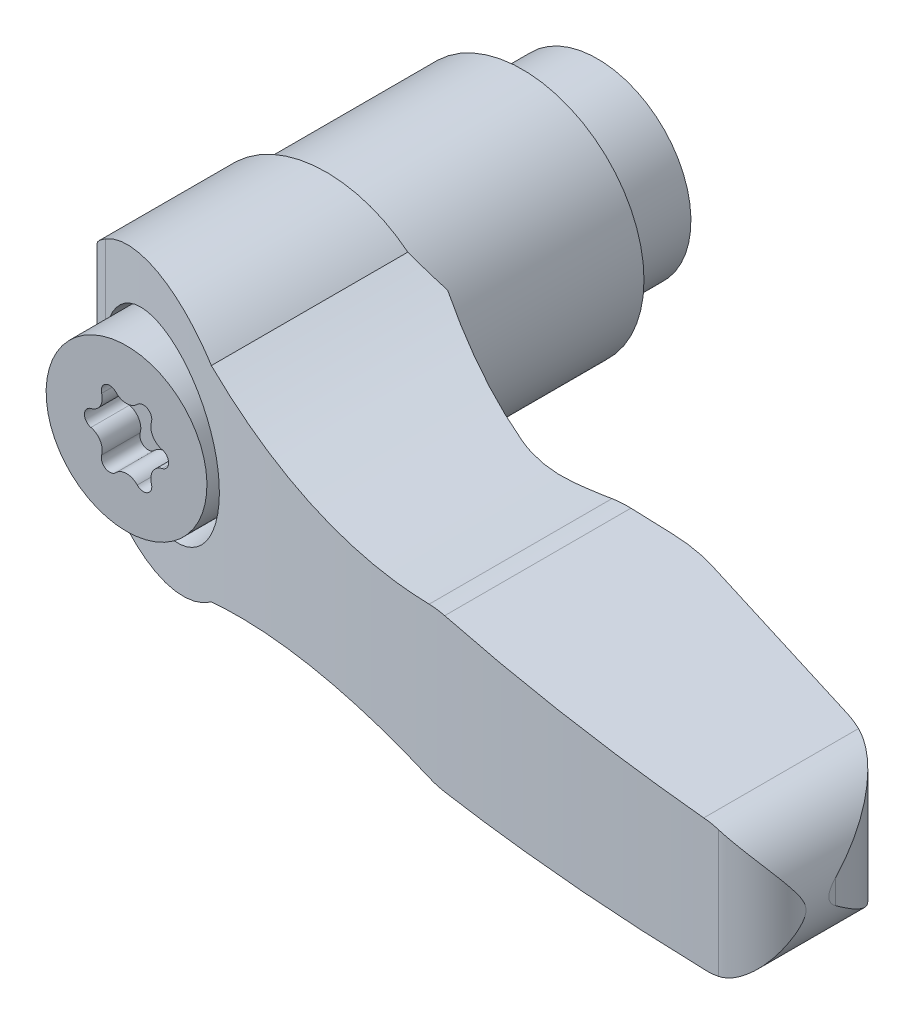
ISO-10303-21;
HEADER;
FILE_DESCRIPTION(('STEP AP214'),'2;1');
FILE_NAME('part.step','',(''),(''),'','','');
FILE_SCHEMA(('AUTOMOTIVE_DESIGN { 1 0 10303 214 1 1 1 1 }'));
ENDSEC;
DATA;
#1=APPLICATION_CONTEXT('core data for automotive mechanical design processes');
#2=APPLICATION_PROTOCOL_DEFINITION('international standard','automotive_design',2000,#1);
#3=PRODUCT_CONTEXT('',#1,'mechanical');
#4=PRODUCT('Part','Part','',(#3));
#5=PRODUCT_RELATED_PRODUCT_CATEGORY('part','',(#4));
#6=PRODUCT_DEFINITION_FORMATION('','',#4);
#7=PRODUCT_DEFINITION_CONTEXT('part definition',#1,'design');
#8=PRODUCT_DEFINITION('design','',#6,#7);
#9=PRODUCT_DEFINITION_SHAPE('','',#8);
#10=(LENGTH_UNIT() NAMED_UNIT(*) SI_UNIT(.MILLI.,.METRE.));
#11=(NAMED_UNIT(*) PLANE_ANGLE_UNIT() SI_UNIT($,.RADIAN.));
#12=(NAMED_UNIT(*) SI_UNIT($,.STERADIAN.) SOLID_ANGLE_UNIT());
#13=UNCERTAINTY_MEASURE_WITH_UNIT(LENGTH_MEASURE(1.E-05),#10,'distance_accuracy_value','');
#14=(GEOMETRIC_REPRESENTATION_CONTEXT(3) GLOBAL_UNCERTAINTY_ASSIGNED_CONTEXT((#13)) GLOBAL_UNIT_ASSIGNED_CONTEXT((#10,
#11,#12)) REPRESENTATION_CONTEXT('',''));
#15=CARTESIAN_POINT('',(0.,0.,0.));
#16=DIRECTION('',(0.,0.,1.));
#17=DIRECTION('',(1.,0.,0.));
#18=AXIS2_PLACEMENT_3D('',#15,#16,#17);
#19=CARTESIAN_POINT('',(-1.9327820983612,0.602050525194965,23.12));
#20=DIRECTION('',(0.,0.,-1.));
#21=DIRECTION('',(0.,1.,0.));
#22=AXIS2_PLACEMENT_3D('',#19,#20,#21);
#23=PLANE('',#22);
#24=CARTESIAN_POINT('',(-2.0755641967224,1.20410105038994,23.12));
#25=DIRECTION('',(0.,0.,-1.));
#26=DIRECTION('',(-1.,0.,0.));
#27=AXIS2_PLACEMENT_3D('',#24,#25,#26);
#28=CIRCLE('',#27,0.787499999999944);
#29=CARTESIAN_POINT('',(-1.32111425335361,1.4298476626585,23.12));
#30=VERTEX_POINT('',#29);
#31=CARTESIAN_POINT('',(-1.8938415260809,0.437854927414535,23.12));
#32=VERTEX_POINT('',#31);
#33=EDGE_CURVE('E550',#30,#32,#28,.T.);
#34=ORIENTED_EDGE('',*,*,#33,.T.);
#35=CARTESIAN_POINT('',(-1.79,0.,23.12));
#36=DIRECTION('',(0.,0.,1.));
#37=DIRECTION('',(1.,0.,0.));
#38=AXIS2_PLACEMENT_3D('',#35,#36,#37);
#39=CIRCLE('',#38,0.45);
#40=CARTESIAN_POINT('',(-1.8938415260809,-0.437854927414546,23.12));
#41=VERTEX_POINT('',#40);
#42=EDGE_CURVE('E1290',#32,#41,#39,.T.);
#43=ORIENTED_EDGE('',*,*,#42,.T.);
#44=CARTESIAN_POINT('',(-2.07556419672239,-1.20410105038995,23.12));
#45=DIRECTION('',(0.,0.,-1.));
#46=DIRECTION('',(-1.,0.,0.));
#47=AXIS2_PLACEMENT_3D('',#44,#45,#46);
#48=CIRCLE('',#47,0.787499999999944);
#49=CARTESIAN_POINT('',(-1.3211142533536,-1.4298476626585,23.12));
#50=VERTEX_POINT('',#49);
#51=EDGE_CURVE('E268',#41,#50,#48,.T.);
#52=ORIENTED_EDGE('',*,*,#51,.T.);
#53=CARTESIAN_POINT('',(-0.889999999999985,-1.55884572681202,23.12));
#54=DIRECTION('',(0.,0.,1.));
#55=DIRECTION('',(1.,0.,0.));
#56=AXIS2_PLACEMENT_3D('',#53,#54,#55);
#57=CIRCLE('',#56,0.45);
#58=CARTESIAN_POINT('',(-0.562727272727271,-1.8677025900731,23.12));
#59=VERTEX_POINT('',#58);
#60=EDGE_CURVE('E1289',#50,#59,#57,.T.);
#61=ORIENTED_EDGE('',*,*,#60,.T.);
#62=CARTESIAN_POINT('',(0.0100000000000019,-2.40820210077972,23.12));
#63=DIRECTION('',(0.,0.,-1.));
#64=DIRECTION('',(-1.,0.,0.));
#65=AXIS2_PLACEMENT_3D('',#62,#63,#64);
#66=CIRCLE('',#65,0.787499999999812);
#67=CARTESIAN_POINT('',(0.582727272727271,-1.8677025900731,23.12));
#68=VERTEX_POINT('',#67);
#69=EDGE_CURVE('E1294',#59,#68,#66,.T.);
#70=ORIENTED_EDGE('',*,*,#69,.T.);
#71=CARTESIAN_POINT('',(0.909999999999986,-1.55884572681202,23.12));
#72=DIRECTION('',(0.,0.,1.));
#73=DIRECTION('',(-1.,0.,0.));
#74=AXIS2_PLACEMENT_3D('',#71,#72,#73);
#75=CIRCLE('',#74,0.45);
#76=CARTESIAN_POINT('',(1.3411142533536,-1.42984766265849,23.12));
#77=VERTEX_POINT('',#76);
#78=EDGE_CURVE('E1279',#68,#77,#75,.T.);
#79=ORIENTED_EDGE('',*,*,#78,.T.);
#80=CARTESIAN_POINT('',(2.09556419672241,-1.20410105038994,23.12));
#81=DIRECTION('',(0.,0.,-1.));
#82=DIRECTION('',(1.,0.,0.));
#83=AXIS2_PLACEMENT_3D('',#80,#81,#82);
#84=CIRCLE('',#83,0.787499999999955);
#85=CARTESIAN_POINT('',(1.91384152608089,-0.437854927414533,23.12));
#86=VERTEX_POINT('',#85);
#87=EDGE_CURVE('E1304',#77,#86,#84,.T.);
#88=ORIENTED_EDGE('',*,*,#87,.T.);
#89=CARTESIAN_POINT('',(1.81,0.,23.12));
#90=DIRECTION('',(0.,0.,1.));
#91=DIRECTION('',(-1.,0.,0.));
#92=AXIS2_PLACEMENT_3D('',#89,#90,#91);
#93=CIRCLE('',#92,0.45);
#94=CARTESIAN_POINT('',(1.91384152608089,0.437854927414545,23.12));
#95=VERTEX_POINT('',#94);
#96=EDGE_CURVE('E1308',#86,#95,#93,.T.);
#97=ORIENTED_EDGE('',*,*,#96,.T.);
#98=CARTESIAN_POINT('',(2.09556419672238,1.20410105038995,23.12));
#99=DIRECTION('',(0.,0.,-1.));
#100=DIRECTION('',(1.,0.,0.));
#101=AXIS2_PLACEMENT_3D('',#98,#99,#100);
#102=CIRCLE('',#101,0.787499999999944);
#103=CARTESIAN_POINT('',(1.34111425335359,1.4298476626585,23.12));
#104=VERTEX_POINT('',#103);
#105=EDGE_CURVE('E1312',#95,#104,#102,.T.);
#106=ORIENTED_EDGE('',*,*,#105,.T.);
#107=CARTESIAN_POINT('',(0.909999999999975,1.55884572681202,23.12));
#108=DIRECTION('',(0.,0.,1.));
#109=DIRECTION('',(-1.,0.,0.));
#110=AXIS2_PLACEMENT_3D('',#107,#108,#109);
#111=CIRCLE('',#110,0.45);
#112=CARTESIAN_POINT('',(0.582727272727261,1.86770259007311,23.12));
#113=VERTEX_POINT('',#112);
#114=EDGE_CURVE('E1316',#104,#113,#111,.T.);
#115=ORIENTED_EDGE('',*,*,#114,.T.);
#116=CARTESIAN_POINT('',(0.0099999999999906,2.40820210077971,23.12));
#117=DIRECTION('',(0.,0.,-1.));
#118=DIRECTION('',(-1.,0.,0.));
#119=AXIS2_PLACEMENT_3D('',#116,#117,#118);
#120=CIRCLE('',#119,0.787499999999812);
#121=CARTESIAN_POINT('',(-0.562727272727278,1.8677025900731,23.12));
#122=VERTEX_POINT('',#121);
#123=EDGE_CURVE('E1320',#113,#122,#120,.T.);
#124=ORIENTED_EDGE('',*,*,#123,.T.);
#125=CARTESIAN_POINT('',(-0.89,1.55884572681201,23.12));
#126=DIRECTION('',(0.,0.,1.));
#127=DIRECTION('',(1.,0.,0.));
#128=AXIS2_PLACEMENT_3D('',#125,#126,#127);
#129=CIRCLE('',#128,0.45);
#130=EDGE_CURVE('E1324',#122,#30,#129,.T.);
#131=ORIENTED_EDGE('',*,*,#130,.T.);
#132=EDGE_LOOP('',(#34,#43,#52,#61,#70,#79,#88,#97,#106,#115,#124,#131));
#133=FACE_BOUND('',#132,.T.);
#134=ADVANCED_FACE('F14',(#133),#23,.F.);
#135=CARTESIAN_POINT('',(-2.07556419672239,-1.20410105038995,27.24));
#136=DIRECTION('',(0.,0.,-1.));
#137=DIRECTION('',(0.,1.,0.));
#138=AXIS2_PLACEMENT_3D('',#135,#136,#137);
#139=CYLINDRICAL_SURFACE('',#138,0.787499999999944);
#140=DIRECTION('',(0.,0.,-1.));
#141=VECTOR('',#140,1.);
#142=CARTESIAN_POINT('',(-1.3211142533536,-1.4298476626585,27.24));
#143=LINE('',#142,#141);
#144=CARTESIAN_POINT('',(-1.3211142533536,-1.4298476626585,25.18));
#145=VERTEX_POINT('',#144);
#146=EDGE_CURVE('E269',#145,#50,#143,.T.);
#147=ORIENTED_EDGE('',*,*,#146,.T.);
#148=ORIENTED_EDGE('',*,*,#51,.F.);
#149=DIRECTION('',(0.,0.,-1.));
#150=VECTOR('',#149,1.);
#151=CARTESIAN_POINT('',(-1.8938415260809,-0.437854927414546,27.24));
#152=LINE('',#151,#150);
#153=CARTESIAN_POINT('',(-1.8938415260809,-0.437854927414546,25.18));
#154=VERTEX_POINT('',#153);
#155=EDGE_CURVE('E255',#154,#41,#152,.T.);
#156=ORIENTED_EDGE('',*,*,#155,.F.);
#157=CARTESIAN_POINT('',(-2.07556419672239,-1.20410105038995,25.18));
#158=DIRECTION('',(0.,0.,1.));
#159=DIRECTION('',(0.,-1.,0.));
#160=AXIS2_PLACEMENT_3D('',#157,#158,#159);
#161=CIRCLE('',#160,0.787499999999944);
#162=EDGE_CURVE('E261',#145,#154,#161,.T.);
#163=ORIENTED_EDGE('',*,*,#162,.F.);
#164=EDGE_LOOP('',(#147,#148,#156,#163));
#165=FACE_BOUND('',#164,.T.);
#166=ADVANCED_FACE('F265',(#165),#139,.T.);
#167=CARTESIAN_POINT('',(-0.889999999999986,-1.55884572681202,27.24));
#168=DIRECTION('',(0.,0.,-1.));
#169=DIRECTION('',(0.,1.,0.));
#170=AXIS2_PLACEMENT_3D('',#167,#168,#169);
#171=CYLINDRICAL_SURFACE('',#170,0.45);
#172=DIRECTION('',(0.,0.,-1.));
#173=VECTOR('',#172,1.);
#174=CARTESIAN_POINT('',(-0.562727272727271,-1.8677025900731,27.24));
#175=LINE('',#174,#173);
#176=CARTESIAN_POINT('',(-0.562727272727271,-1.8677025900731,25.18));
#177=VERTEX_POINT('',#176);
#178=EDGE_CURVE('E1275',#177,#59,#175,.T.);
#179=ORIENTED_EDGE('',*,*,#178,.T.);
#180=ORIENTED_EDGE('',*,*,#60,.F.);
#181=ORIENTED_EDGE('',*,*,#146,.F.);
#182=CARTESIAN_POINT('',(-0.889999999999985,-1.55884572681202,25.18));
#183=DIRECTION('',(0.,0.,1.));
#184=DIRECTION('',(0.,-1.,0.));
#185=AXIS2_PLACEMENT_3D('',#182,#183,#184);
#186=CIRCLE('',#185,0.45);
#187=EDGE_CURVE('E274',#177,#145,#186,.F.);
#188=ORIENTED_EDGE('',*,*,#187,.F.);
#189=EDGE_LOOP('',(#179,#180,#181,#188));
#190=FACE_BOUND('',#189,.T.);
#191=ADVANCED_FACE('F483',(#190),#171,.F.);
#192=CARTESIAN_POINT('',(0.0100000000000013,-2.40820210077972,27.24));
#193=DIRECTION('',(0.,0.,-1.));
#194=DIRECTION('',(0.,1.,0.));
#195=AXIS2_PLACEMENT_3D('',#192,#193,#194);
#196=CYLINDRICAL_SURFACE('',#195,0.787499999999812);
#197=DIRECTION('',(0.,0.,-1.));
#198=VECTOR('',#197,1.);
#199=CARTESIAN_POINT('',(0.58272727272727,-1.8677025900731,27.24));
#200=LINE('',#199,#198);
#201=CARTESIAN_POINT('',(0.582727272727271,-1.8677025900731,25.18));
#202=VERTEX_POINT('',#201);
#203=EDGE_CURVE('E1273',#202,#68,#200,.T.);
#204=ORIENTED_EDGE('',*,*,#203,.T.);
#205=ORIENTED_EDGE('',*,*,#69,.F.);
#206=ORIENTED_EDGE('',*,*,#178,.F.);
#207=CARTESIAN_POINT('',(0.0100000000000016,-2.40820210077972,25.18));
#208=DIRECTION('',(0.,0.,1.));
#209=DIRECTION('',(0.,-1.,0.));
#210=AXIS2_PLACEMENT_3D('',#207,#208,#209);
#211=CIRCLE('',#210,0.787499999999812);
#212=EDGE_CURVE('E276',#202,#177,#211,.T.);
#213=ORIENTED_EDGE('',*,*,#212,.F.);
#214=EDGE_LOOP('',(#204,#205,#206,#213));
#215=FACE_BOUND('',#214,.T.);
#216=ADVANCED_FACE('F514',(#215),#196,.T.);
#217=CARTESIAN_POINT('',(0.909999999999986,-1.55884572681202,27.24));
#218=DIRECTION('',(0.,0.,-1.));
#219=DIRECTION('',(0.,1.,0.));
#220=AXIS2_PLACEMENT_3D('',#217,#218,#219);
#221=CYLINDRICAL_SURFACE('',#220,0.45);
#222=DIRECTION('',(0.,0.,-1.));
#223=VECTOR('',#222,1.);
#224=CARTESIAN_POINT('',(1.3411142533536,-1.42984766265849,27.24));
#225=LINE('',#224,#223);
#226=CARTESIAN_POINT('',(1.3411142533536,-1.42984766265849,25.18));
#227=VERTEX_POINT('',#226);
#228=EDGE_CURVE('E1280',#227,#77,#225,.T.);
#229=ORIENTED_EDGE('',*,*,#228,.T.);
#230=ORIENTED_EDGE('',*,*,#78,.F.);
#231=ORIENTED_EDGE('',*,*,#203,.F.);
#232=CARTESIAN_POINT('',(0.909999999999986,-1.55884572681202,25.18));
#233=DIRECTION('',(0.,0.,1.));
#234=DIRECTION('',(0.,-1.,0.));
#235=AXIS2_PLACEMENT_3D('',#232,#233,#234);
#236=CIRCLE('',#235,0.45);
#237=EDGE_CURVE('E1268',#227,#202,#236,.F.);
#238=ORIENTED_EDGE('',*,*,#237,.F.);
#239=EDGE_LOOP('',(#229,#230,#231,#238));
#240=FACE_BOUND('',#239,.T.);
#241=ADVANCED_FACE('F510',(#240),#221,.F.);
#242=CARTESIAN_POINT('',(2.09556419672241,-1.20410105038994,27.24));
#243=DIRECTION('',(0.,0.,-1.));
#244=DIRECTION('',(0.,1.,0.));
#245=AXIS2_PLACEMENT_3D('',#242,#243,#244);
#246=CYLINDRICAL_SURFACE('',#245,0.787499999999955);
#247=DIRECTION('',(0.,0.,-1.));
#248=VECTOR('',#247,1.);
#249=CARTESIAN_POINT('',(1.91384152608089,-0.437854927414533,27.24));
#250=LINE('',#249,#248);
#251=CARTESIAN_POINT('',(1.91384152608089,-0.437854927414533,25.18));
#252=VERTEX_POINT('',#251);
#253=EDGE_CURVE('E1283',#252,#86,#250,.T.);
#254=ORIENTED_EDGE('',*,*,#253,.T.);
#255=ORIENTED_EDGE('',*,*,#87,.F.);
#256=ORIENTED_EDGE('',*,*,#228,.F.);
#257=CARTESIAN_POINT('',(2.09556419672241,-1.20410105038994,25.18));
#258=DIRECTION('',(0.,0.,1.));
#259=DIRECTION('',(0.,-1.,0.));
#260=AXIS2_PLACEMENT_3D('',#257,#258,#259);
#261=CIRCLE('',#260,0.787499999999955);
#262=EDGE_CURVE('E1265',#252,#227,#261,.T.);
#263=ORIENTED_EDGE('',*,*,#262,.F.);
#264=EDGE_LOOP('',(#254,#255,#256,#263));
#265=FACE_BOUND('',#264,.T.);
#266=ADVANCED_FACE('F506',(#265),#246,.T.);
#267=CARTESIAN_POINT('',(1.81,0.,27.24));
#268=DIRECTION('',(0.,0.,-1.));
#269=DIRECTION('',(0.,1.,0.));
#270=AXIS2_PLACEMENT_3D('',#267,#268,#269);
#271=CYLINDRICAL_SURFACE('',#270,0.45);
#272=DIRECTION('',(0.,0.,-1.));
#273=VECTOR('',#272,1.);
#274=CARTESIAN_POINT('',(1.91384152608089,0.437854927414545,27.24));
#275=LINE('',#274,#273);
#276=CARTESIAN_POINT('',(1.91384152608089,0.437854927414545,25.18));
#277=VERTEX_POINT('',#276);
#278=EDGE_CURVE('E1337',#277,#95,#275,.T.);
#279=ORIENTED_EDGE('',*,*,#278,.T.);
#280=ORIENTED_EDGE('',*,*,#96,.F.);
#281=ORIENTED_EDGE('',*,*,#253,.F.);
#282=CARTESIAN_POINT('',(1.81,0.,25.18));
#283=DIRECTION('',(0.,0.,1.));
#284=DIRECTION('',(0.,-1.,0.));
#285=AXIS2_PLACEMENT_3D('',#282,#283,#284);
#286=CIRCLE('',#285,0.45);
#287=EDGE_CURVE('E1262',#277,#252,#286,.F.);
#288=ORIENTED_EDGE('',*,*,#287,.F.);
#289=EDGE_LOOP('',(#279,#280,#281,#288));
#290=FACE_BOUND('',#289,.T.);
#291=ADVANCED_FACE('F502',(#290),#271,.F.);
#292=CARTESIAN_POINT('',(2.09556419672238,1.20410105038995,27.24));
#293=DIRECTION('',(0.,0.,-1.));
#294=DIRECTION('',(0.,1.,0.));
#295=AXIS2_PLACEMENT_3D('',#292,#293,#294);
#296=CYLINDRICAL_SURFACE('',#295,0.787499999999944);
#297=DIRECTION('',(0.,0.,-1.));
#298=VECTOR('',#297,1.);
#299=CARTESIAN_POINT('',(1.34111425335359,1.4298476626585,27.24));
#300=LINE('',#299,#298);
#301=CARTESIAN_POINT('',(1.34111425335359,1.4298476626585,25.18));
#302=VERTEX_POINT('',#301);
#303=EDGE_CURVE('E1335',#302,#104,#300,.T.);
#304=ORIENTED_EDGE('',*,*,#303,.T.);
#305=ORIENTED_EDGE('',*,*,#105,.F.);
#306=ORIENTED_EDGE('',*,*,#278,.F.);
#307=CARTESIAN_POINT('',(2.09556419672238,1.20410105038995,25.18));
#308=DIRECTION('',(0.,0.,1.));
#309=DIRECTION('',(0.,-1.,0.));
#310=AXIS2_PLACEMENT_3D('',#307,#308,#309);
#311=CIRCLE('',#310,0.787499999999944);
#312=EDGE_CURVE('E1259',#302,#277,#311,.T.);
#313=ORIENTED_EDGE('',*,*,#312,.F.);
#314=EDGE_LOOP('',(#304,#305,#306,#313));
#315=FACE_BOUND('',#314,.T.);
#316=ADVANCED_FACE('F498',(#315),#296,.T.);
#317=CARTESIAN_POINT('',(0.909999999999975,1.55884572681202,27.24));
#318=DIRECTION('',(0.,0.,-1.));
#319=DIRECTION('',(0.,1.,0.));
#320=AXIS2_PLACEMENT_3D('',#317,#318,#319);
#321=CYLINDRICAL_SURFACE('',#320,0.45);
#322=DIRECTION('',(0.,0.,-1.));
#323=VECTOR('',#322,1.);
#324=CARTESIAN_POINT('',(0.58272727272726,1.86770259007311,27.24));
#325=LINE('',#324,#323);
#326=CARTESIAN_POINT('',(0.582727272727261,1.86770259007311,25.18));
#327=VERTEX_POINT('',#326);
#328=EDGE_CURVE('E1333',#327,#113,#325,.T.);
#329=ORIENTED_EDGE('',*,*,#328,.T.);
#330=ORIENTED_EDGE('',*,*,#114,.F.);
#331=ORIENTED_EDGE('',*,*,#303,.F.);
#332=CARTESIAN_POINT('',(0.909999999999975,1.55884572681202,25.18));
#333=DIRECTION('',(0.,0.,1.));
#334=DIRECTION('',(0.,-1.,0.));
#335=AXIS2_PLACEMENT_3D('',#332,#333,#334);
#336=CIRCLE('',#335,0.45);
#337=EDGE_CURVE('E1256',#327,#302,#336,.F.);
#338=ORIENTED_EDGE('',*,*,#337,.F.);
#339=EDGE_LOOP('',(#329,#330,#331,#338));
#340=FACE_BOUND('',#339,.T.);
#341=ADVANCED_FACE('F494',(#340),#321,.F.);
#342=CARTESIAN_POINT('',(0.00999999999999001,2.40820210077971,27.24));
#343=DIRECTION('',(0.,0.,-1.));
#344=DIRECTION('',(0.,1.,0.));
#345=AXIS2_PLACEMENT_3D('',#342,#343,#344);
#346=CYLINDRICAL_SURFACE('',#345,0.787499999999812);
#347=DIRECTION('',(0.,0.,-1.));
#348=VECTOR('',#347,1.);
#349=CARTESIAN_POINT('',(-0.562727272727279,1.8677025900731,27.24));
#350=LINE('',#349,#348);
#351=CARTESIAN_POINT('',(-0.562727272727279,1.8677025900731,25.18));
#352=VERTEX_POINT('',#351);
#353=EDGE_CURVE('E39',#352,#122,#350,.T.);
#354=ORIENTED_EDGE('',*,*,#353,.T.);
#355=ORIENTED_EDGE('',*,*,#123,.F.);
#356=ORIENTED_EDGE('',*,*,#328,.F.);
#357=CARTESIAN_POINT('',(0.00999999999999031,2.40820210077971,25.18));
#358=DIRECTION('',(0.,0.,1.));
#359=DIRECTION('',(0.,-1.,0.));
#360=AXIS2_PLACEMENT_3D('',#357,#358,#359);
#361=CIRCLE('',#360,0.787499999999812);
#362=EDGE_CURVE('E1253',#352,#327,#361,.T.);
#363=ORIENTED_EDGE('',*,*,#362,.F.);
#364=EDGE_LOOP('',(#354,#355,#356,#363));
#365=FACE_BOUND('',#364,.T.);
#366=ADVANCED_FACE('F491',(#365),#346,.T.);
#367=CARTESIAN_POINT('',(-0.89,1.55884572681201,27.24));
#368=DIRECTION('',(0.,0.,-1.));
#369=DIRECTION('',(0.,1.,0.));
#370=AXIS2_PLACEMENT_3D('',#367,#368,#369);
#371=CYLINDRICAL_SURFACE('',#370,0.45);
#372=DIRECTION('',(0.,0.,-1.));
#373=VECTOR('',#372,1.);
#374=CARTESIAN_POINT('',(-1.32111425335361,1.4298476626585,27.24));
#375=LINE('',#374,#373);
#376=CARTESIAN_POINT('',(-1.32111425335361,1.4298476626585,25.18));
#377=VERTEX_POINT('',#376);
#378=EDGE_CURVE('E1328',#377,#30,#375,.T.);
#379=ORIENTED_EDGE('',*,*,#378,.T.);
#380=ORIENTED_EDGE('',*,*,#130,.F.);
#381=ORIENTED_EDGE('',*,*,#353,.F.);
#382=CARTESIAN_POINT('',(-0.89,1.55884572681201,25.18));
#383=DIRECTION('',(0.,0.,1.));
#384=DIRECTION('',(0.,-1.,0.));
#385=AXIS2_PLACEMENT_3D('',#382,#383,#384);
#386=CIRCLE('',#385,0.45);
#387=EDGE_CURVE('E1247',#377,#352,#386,.F.);
#388=ORIENTED_EDGE('',*,*,#387,.F.);
#389=EDGE_LOOP('',(#379,#380,#381,#388));
#390=FACE_BOUND('',#389,.T.);
#391=ADVANCED_FACE('F487',(#390),#371,.F.);
#392=CARTESIAN_POINT('',(-2.0755641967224,1.20410105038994,27.24));
#393=DIRECTION('',(0.,0.,-1.));
#394=DIRECTION('',(0.,1.,0.));
#395=AXIS2_PLACEMENT_3D('',#392,#393,#394);
#396=CYLINDRICAL_SURFACE('',#395,0.787499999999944);
#397=DIRECTION('',(0.,0.,-1.));
#398=VECTOR('',#397,1.);
#399=CARTESIAN_POINT('',(-1.89384152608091,0.437854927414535,27.24));
#400=LINE('',#399,#398);
#401=CARTESIAN_POINT('',(-1.8938415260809,0.437854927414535,25.18));
#402=VERTEX_POINT('',#401);
#403=EDGE_CURVE('E190',#402,#32,#400,.T.);
#404=ORIENTED_EDGE('',*,*,#403,.T.);
#405=ORIENTED_EDGE('',*,*,#33,.F.);
#406=ORIENTED_EDGE('',*,*,#378,.F.);
#407=CARTESIAN_POINT('',(-2.0755641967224,1.20410105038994,25.18));
#408=DIRECTION('',(0.,0.,1.));
#409=DIRECTION('',(0.,-1.,0.));
#410=AXIS2_PLACEMENT_3D('',#407,#408,#409);
#411=CIRCLE('',#410,0.787499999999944);
#412=EDGE_CURVE('E260',#402,#377,#411,.T.);
#413=ORIENTED_EDGE('',*,*,#412,.F.);
#414=EDGE_LOOP('',(#404,#405,#406,#413));
#415=FACE_BOUND('',#414,.T.);
#416=ADVANCED_FACE('F490',(#415),#396,.T.);
#417=CARTESIAN_POINT('',(-1.79,0.,27.24));
#418=DIRECTION('',(0.,0.,-1.));
#419=DIRECTION('',(0.,1.,0.));
#420=AXIS2_PLACEMENT_3D('',#417,#418,#419);
#421=CYLINDRICAL_SURFACE('',#420,0.45);
#422=ORIENTED_EDGE('',*,*,#155,.T.);
#423=ORIENTED_EDGE('',*,*,#42,.F.);
#424=ORIENTED_EDGE('',*,*,#403,.F.);
#425=CARTESIAN_POINT('',(-1.79,0.,25.18));
#426=DIRECTION('',(0.,0.,1.));
#427=DIRECTION('',(0.,-1.,0.));
#428=AXIS2_PLACEMENT_3D('',#425,#426,#427);
#429=CIRCLE('',#428,0.45);
#430=EDGE_CURVE('E252',#154,#402,#429,.F.);
#431=ORIENTED_EDGE('',*,*,#430,.F.);
#432=EDGE_LOOP('',(#422,#423,#424,#431));
#433=FACE_BOUND('',#432,.T.);
#434=ADVANCED_FACE('F254',(#433),#421,.F.);
#435=CARTESIAN_POINT('',(0.00999999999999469,0.,25.18));
#436=DIRECTION('',(0.,0.,1.));
#437=DIRECTION('',(0.,-1.,0.));
#438=AXIS2_PLACEMENT_3D('',#435,#436,#437);
#439=PLANE('',#438);
#440=CARTESIAN_POINT('',(0.00999999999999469,0.,25.18));
#441=DIRECTION('',(0.,0.,1.));
#442=DIRECTION('',(0.,-1.,0.));
#443=AXIS2_PLACEMENT_3D('',#440,#441,#442);
#444=CIRCLE('',#443,4.3);
#445=CARTESIAN_POINT('',(0.0100000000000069,-4.3,25.18));
#446=VERTEX_POINT('',#445);
#447=EDGE_CURVE('E545',#446,#446,#444,.T.);
#448=ORIENTED_EDGE('',*,*,#447,.T.);
#449=EDGE_LOOP('',(#448));
#450=FACE_BOUND('',#449,.T.);
#451=ORIENTED_EDGE('',*,*,#430,.T.);
#452=ORIENTED_EDGE('',*,*,#412,.T.);
#453=ORIENTED_EDGE('',*,*,#387,.T.);
#454=ORIENTED_EDGE('',*,*,#362,.T.);
#455=ORIENTED_EDGE('',*,*,#337,.T.);
#456=ORIENTED_EDGE('',*,*,#312,.T.);
#457=ORIENTED_EDGE('',*,*,#287,.T.);
#458=ORIENTED_EDGE('',*,*,#262,.T.);
#459=ORIENTED_EDGE('',*,*,#237,.T.);
#460=ORIENTED_EDGE('',*,*,#212,.T.);
#461=ORIENTED_EDGE('',*,*,#187,.T.);
#462=ORIENTED_EDGE('',*,*,#162,.T.);
#463=EDGE_LOOP('',(#451,#452,#453,#454,#455,#456,#457,#458,#459,#460,#461,#462));
#464=FACE_BOUND('',#463,.T.);
#465=ADVANCED_FACE('F272',(#450,#464),#439,.T.);
#466=CARTESIAN_POINT('',(0.00999999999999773,0.,4.));
#467=DIRECTION('',(0.,0.,1.));
#468=DIRECTION('',(0.,-1.,0.));
#469=AXIS2_PLACEMENT_3D('',#466,#467,#468);
#470=CYLINDRICAL_SURFACE('',#469,4.3);
#471=ORIENTED_EDGE('',*,*,#447,.F.);
#472=EDGE_LOOP('',(#471));
#473=FACE_BOUND('',#472,.T.);
#474=CARTESIAN_POINT('',(0.00999999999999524,0.,21.34));
#475=DIRECTION('',(0.,0.,1.));
#476=DIRECTION('',(0.,-1.,0.));
#477=AXIS2_PLACEMENT_3D('',#474,#475,#476);
#478=CIRCLE('',#477,4.3);
#479=CARTESIAN_POINT('',(0.0100000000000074,-4.3,21.34));
#480=VERTEX_POINT('',#479);
#481=EDGE_CURVE('E30',#480,#480,#478,.T.);
#482=ORIENTED_EDGE('',*,*,#481,.T.);
#483=EDGE_LOOP('',(#482));
#484=FACE_BOUND('',#483,.T.);
#485=ADVANCED_FACE('F303',(#473,#484),#470,.T.);
#486=CARTESIAN_POINT('',(0.,0.,16.5625));
#487=DIRECTION('',(0.,0.,-1.));
#488=DIRECTION('',(1.,0.,0.));
#489=AXIS2_PLACEMENT_3D('',#486,#487,#488);
#490=CYLINDRICAL_SURFACE('',#489,6.5);
#491=CARTESIAN_POINT('',(0.,0.,14.5));
#492=DIRECTION('',(0.,0.,1.));
#493=DIRECTION('',(0.,-1.,0.));
#494=AXIS2_PLACEMENT_3D('',#491,#492,#493);
#495=CIRCLE('',#494,6.5);
#496=CARTESIAN_POINT('',(-6.5,0.,14.5));
#497=VERTEX_POINT('',#496);
#498=CARTESIAN_POINT('',(6.5,0.,14.5));
#499=VERTEX_POINT('',#498);
#500=EDGE_CURVE('E1222',#497,#499,#495,.T.);
#501=ORIENTED_EDGE('',*,*,#500,.F.);
#502=EDGE_CURVE('E1221',#499,#497,#495,.T.);
#503=ORIENTED_EDGE('',*,*,#502,.F.);
#504=EDGE_LOOP('',(#501,#503));
#505=FACE_BOUND('',#504,.T.);
#506=CARTESIAN_POINT('',(0.,0.,-2.3500226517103));
#507=DIRECTION('',(0.707106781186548,0.,0.707106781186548));
#508=DIRECTION('',(0.707106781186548,0.,-0.707106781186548));
#509=AXIS2_PLACEMENT_3D('',#506,#507,#508);
#510=ELLIPSE('',#509,9.19238815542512,6.5);
#511=CARTESIAN_POINT('',(-6.3500226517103,-1.38824072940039,4.));
#512=VERTEX_POINT('',#511);
#513=CARTESIAN_POINT('',(-6.35002265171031,1.38824072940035,4.));
#514=VERTEX_POINT('',#513);
#515=EDGE_CURVE('E1228',#512,#514,#510,.F.);
#516=ORIENTED_EDGE('',*,*,#515,.F.);
#517=CARTESIAN_POINT('',(0.,0.,4.));
#518=DIRECTION('',(0.,0.,-1.));
#519=DIRECTION('',(1.,0.,0.));
#520=AXIS2_PLACEMENT_3D('',#517,#518,#519);
#521=CIRCLE('',#520,6.5);
#522=EDGE_CURVE('E176',#514,#512,#521,.T.);
#523=ORIENTED_EDGE('',*,*,#522,.F.);
#524=EDGE_LOOP('',(#516,#523));
#525=FACE_BOUND('',#524,.T.);
#526=ADVANCED_FACE('F309',(#505,#525),#490,.T.);
#527=CARTESIAN_POINT('',(-6.5,-14.,4.1499773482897));
#528=DIRECTION('',(0.707106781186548,0.,0.707106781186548));
#529=DIRECTION('',(-0.707106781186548,0.,0.707106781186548));
#530=AXIS2_PLACEMENT_3D('',#527,#528,#529);
#531=PLANE('',#530);
#532=ORIENTED_EDGE('',*,*,#515,.T.);
#533=DIRECTION('',(0.,1.,0.));
#534=VECTOR('',#533,1.);
#535=CARTESIAN_POINT('',(-6.35002265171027,-14.,4.));
#536=LINE('',#535,#534);
#537=EDGE_CURVE('E289',#512,#514,#536,.T.);
#538=ORIENTED_EDGE('',*,*,#537,.F.);
#539=EDGE_LOOP('',(#532,#538));
#540=FACE_BOUND('',#539,.T.);
#541=ADVANCED_FACE('F302',(#540),#531,.F.);
#542=CARTESIAN_POINT('',(0.,0.,4.));
#543=DIRECTION('',(0.,0.,-1.));
#544=DIRECTION('',(1.,0.,0.));
#545=AXIS2_PLACEMENT_3D('',#542,#543,#544);
#546=PLANE('',#545);
#547=ORIENTED_EDGE('',*,*,#537,.T.);
#548=ORIENTED_EDGE('',*,*,#522,.T.);
#549=EDGE_LOOP('',(#547,#548));
#550=FACE_BOUND('',#549,.T.);
#551=CARTESIAN_POINT('',(0.00999999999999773,0.,4.));
#552=DIRECTION('',(0.,0.,-1.));
#553=DIRECTION('',(0.707106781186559,-0.707106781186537,0.));
#554=AXIS2_PLACEMENT_3D('',#551,#552,#553);
#555=CIRCLE('',#554,5.);
#556=CARTESIAN_POINT('',(3.54553390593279,-3.53553390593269,4.));
#557=VERTEX_POINT('',#556);
#558=EDGE_CURVE('E9',#557,#557,#555,.F.);
#559=ORIENTED_EDGE('',*,*,#558,.T.);
#560=EDGE_LOOP('',(#559));
#561=FACE_BOUND('',#560,.T.);
#562=ADVANCED_FACE('F308',(#550,#561),#546,.T.);
#563=CARTESIAN_POINT('',(39.948965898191,-7.99999999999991,27.204249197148));
#564=DIRECTION('',(-0.989626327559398,0.,0.143665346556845));
#565=DIRECTION('',(-0.143665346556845,0.,-0.989626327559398));
#566=AXIS2_PLACEMENT_3D('',#563,#564,#565);
#567=PLANE('',#566);
#568=CARTESIAN_POINT('',(36.51,1.03135578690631E-13,3.51522972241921));
#569=DIRECTION('',(-0.989626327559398,0.,0.143665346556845));
#570=DIRECTION('',(0.143665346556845,0.,0.989626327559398));
#571=AXIS2_PLACEMENT_3D('',#568,#569,#570);
#572=ELLIPSE('',#571,24.3621728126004,3.5);
#573=CARTESIAN_POINT('',(39.948965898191,-0.650779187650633,27.204249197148));
#574=VERTEX_POINT('',#573);
#575=CARTESIAN_POINT('',(39.9489658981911,0.650779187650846,27.204249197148));
#576=VERTEX_POINT('',#575);
#577=EDGE_CURVE('E449',#574,#576,#572,.T.);
#578=ORIENTED_EDGE('',*,*,#577,.F.);
#579=DIRECTION('',(0.,1.,0.));
#580=VECTOR('',#579,1.);
#581=CARTESIAN_POINT('',(39.948965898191,-7.99999999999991,27.204249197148));
#582=LINE('',#581,#580);
#583=EDGE_CURVE('E561',#574,#576,#582,.T.);
#584=ORIENTED_EDGE('',*,*,#583,.T.);
#585=EDGE_LOOP('',(#578,#584));
#586=FACE_BOUND('',#585,.T.);
#587=ADVANCED_FACE('F461',(#586),#567,.F.);
#588=CARTESIAN_POINT('',(33.8726602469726,-8.,28.0863544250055));
#589=DIRECTION('',(0.,1.,0.));
#590=DIRECTION('',(-1.,0.,0.));
#591=AXIS2_PLACEMENT_3D('',#588,#589,#590);
#592=CYLINDRICAL_SURFACE('',#591,6.14000000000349);
#593=CARTESIAN_POINT('',(33.8726602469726,3.59762871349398,28.0863544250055));
#594=DIRECTION('',(0.0369925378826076,0.999315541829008,0.));
#595=DIRECTION('',(-0.999315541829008,0.0369925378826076,0.));
#596=AXIS2_PLACEMENT_3D('',#593,#594,#595);
#597=ELLIPSE('',#596,6.14420545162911,6.14000000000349);
#598=CARTESIAN_POINT('',(36.51,3.50000000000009,22.5416236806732));
#599=VERTEX_POINT('',#598);
#600=CARTESIAN_POINT('',(35.544460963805,3.53574220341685,22.178335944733));
#601=VERTEX_POINT('',#600);
#602=EDGE_CURVE('E701',#599,#601,#597,.T.);
#603=ORIENTED_EDGE('',*,*,#602,.F.);
#604=CARTESIAN_POINT('',(39.9489658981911,0.650779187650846,27.204249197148));
#605=CARTESIAN_POINT('',(39.9347028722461,0.726086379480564,27.1059853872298));
#606=CARTESIAN_POINT('',(39.9179968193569,0.800887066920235,27.0076860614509));
#607=CARTESIAN_POINT('',(39.8796347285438,0.949458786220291,26.8112602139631));
#608=CARTESIAN_POINT('',(39.8579781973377,1.02322971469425,26.7131337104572));
#609=CARTESIAN_POINT('',(39.8095979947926,1.16988012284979,26.5170899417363));
#610=CARTESIAN_POINT('',(39.7828626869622,1.24275713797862,26.4191736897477));
#611=CARTESIAN_POINT('',(39.7242815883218,1.38725410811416,26.2239599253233));
#612=CARTESIAN_POINT('',(39.6924358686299,1.4588740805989,26.1266624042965));
#613=CARTESIAN_POINT('',(39.5882917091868,1.67318502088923,25.8337016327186));
#614=CARTESIAN_POINT('',(39.5079263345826,1.81366367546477,25.6391889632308));
#615=CARTESIAN_POINT('',(39.3250854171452,2.08619457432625,25.2551202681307));
#616=CARTESIAN_POINT('',(39.2226344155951,2.21825596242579,25.0655590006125));
#617=CARTESIAN_POINT('',(38.9695027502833,2.4987733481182,24.6523338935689));
#618=CARTESIAN_POINT('',(38.8131801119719,2.64456339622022,24.4302018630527));
#619=CARTESIAN_POINT('',(38.5517124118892,2.84488994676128,24.108275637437));
#620=CARTESIAN_POINT('',(38.4601831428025,2.90854134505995,24.0029632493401));
#621=CARTESIAN_POINT('',(38.2679442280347,3.02861213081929,23.7967186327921));
#622=CARTESIAN_POINT('',(38.1672360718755,3.08503268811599,23.6957856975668));
#623=CARTESIAN_POINT('',(37.8992625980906,3.21757634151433,23.4457323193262));
#624=CARTESIAN_POINT('',(37.7255213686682,3.28779061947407,23.3001643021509));
#625=CARTESIAN_POINT('',(37.4496992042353,3.37286339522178,23.0946053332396));
#626=CARTESIAN_POINT('',(37.355317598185,3.39783246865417,23.0282732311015));
#627=CARTESIAN_POINT('',(37.1617842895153,3.44019984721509,22.9003457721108));
#628=CARTESIAN_POINT('',(37.0626354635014,3.45760265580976,22.8387476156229));
#629=CARTESIAN_POINT('',(36.8881783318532,3.48029211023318,22.7372021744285));
#630=CARTESIAN_POINT('',(36.8138676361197,3.48759914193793,22.6959814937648));
#631=CARTESIAN_POINT('',(36.6633047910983,3.49745586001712,22.6165121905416));
#632=CARTESIAN_POINT('',(36.5870513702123,3.50000234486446,22.57826558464));
#633=CARTESIAN_POINT('',(36.51,3.50000000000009,22.5416236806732));
#634=B_SPLINE_CURVE_WITH_KNOTS('',3,(#604,#605,#606,#607,#608,#609,#610,#611,#612,#613,#614,
#615,#616,#617,#618,#619,#620,#621,#622,#623,#624,#625,#626,#627,#628,#629,#630,#631,#632,#633),
.UNSPECIFIED.,.F.,.F.,(4,2,2,2,2,2,2,2,2,2,2,2,2,2,4),(0.,0.3738393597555,0.747715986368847,
1.12245980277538,1.49719840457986,2.25512351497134,3.01221072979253,3.93367725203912,
4.39332639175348,4.85290107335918,5.56171222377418,5.91546495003,6.26900683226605,
6.52468766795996,6.78054039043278),.UNSPECIFIED.);
#635=EDGE_CURVE('E448',#576,#599,#634,.T.);
#636=ORIENTED_EDGE('',*,*,#635,.F.);
#637=ORIENTED_EDGE('',*,*,#583,.F.);
#638=CARTESIAN_POINT('',(36.51,-3.49999999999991,22.5416236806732));
#639=CARTESIAN_POINT('',(36.6161539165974,-3.50000941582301,22.5920863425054));
#640=CARTESIAN_POINT('',(36.7207657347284,-3.4951728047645,22.6456099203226));
#641=CARTESIAN_POINT('',(36.9260027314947,-3.47671082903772,22.7581011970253));
#642=CARTESIAN_POINT('',(37.026634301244,-3.46310021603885,22.8170596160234));
#643=CARTESIAN_POINT('',(37.2223479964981,-3.42816986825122,22.9392782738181));
#644=CARTESIAN_POINT('',(37.3174768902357,-3.40693163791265,23.0024874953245));
#645=CARTESIAN_POINT('',(37.5029223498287,-3.35757592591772,23.1332068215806));
#646=CARTESIAN_POINT('',(37.5932363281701,-3.32945478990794,23.2007191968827));
#647=CARTESIAN_POINT('',(37.7930795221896,-3.25850520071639,23.358740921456));
#648=CARTESIAN_POINT('',(37.900992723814,-3.21376078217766,23.4504360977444));
#649=CARTESIAN_POINT('',(38.1082482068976,-3.11588681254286,23.6389903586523));
#650=CARTESIAN_POINT('',(38.2075840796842,-3.06275107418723,23.7358532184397));
#651=CARTESIAN_POINT('',(38.3980468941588,-2.94917464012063,23.934309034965));
#652=CARTESIAN_POINT('',(38.489132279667,-2.88870020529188,24.035922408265));
#653=CARTESIAN_POINT('',(38.6626412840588,-2.76182607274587,24.2426721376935));
#654=CARTESIAN_POINT('',(38.7450674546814,-2.69542813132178,24.3478074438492));
#655=CARTESIAN_POINT('',(38.9329341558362,-2.5299693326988,24.6038856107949));
#656=CARTESIAN_POINT('',(39.0343159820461,-2.42850340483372,24.7562617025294));
#657=CARTESIAN_POINT('',(39.2211706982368,-2.21796613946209,25.0654781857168));
#658=CARTESIAN_POINT('',(39.3066363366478,-2.10889136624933,25.2223205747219));
#659=CARTESIAN_POINT('',(39.4622229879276,-1.88493092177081,25.5392893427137));
#660=CARTESIAN_POINT('',(39.5323498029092,-1.77004746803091,25.6994144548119));
#661=CARTESIAN_POINT('',(39.6578320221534,-1.53583460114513,26.0220530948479));
#662=CARTESIAN_POINT('',(39.7131929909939,-1.41650688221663,26.1845656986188));
#663=CARTESIAN_POINT('',(39.8033776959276,-1.19018579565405,26.4900634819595));
#664=CARTESIAN_POINT('',(39.8399343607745,-1.0836016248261,26.6328455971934));
#665=CARTESIAN_POINT('',(39.9023391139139,-0.86858691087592,26.9185049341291));
#666=CARTESIAN_POINT('',(39.9282264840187,-0.760164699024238,27.0613798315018));
#667=CARTESIAN_POINT('',(39.948965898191,-0.650779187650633,27.204249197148));
#668=B_SPLINE_CURVE_WITH_KNOTS('',3,(#638,#639,#640,#641,#642,#643,#644,#645,#646,#647,#648,
#649,#650,#651,#652,#653,#654,#655,#656,#657,#658,#659,#660,#661,#662,#663,#664,#665,#666,#667),
.UNSPECIFIED.,.F.,.F.,(4,2,2,2,2,2,2,2,2,2,2,2,2,2,4),(0.,0.352350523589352,0.704110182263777,
1.05221781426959,1.40051067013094,1.8453815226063,2.29058194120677,2.73791274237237,
3.18511134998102,3.81198117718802,4.43913591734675,5.06605301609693,5.69273352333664,
6.23807905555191,6.78139842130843),.UNSPECIFIED.);
#669=CARTESIAN_POINT('',(36.51,-3.49999999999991,22.5416236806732));
#670=VERTEX_POINT('',#669);
#671=EDGE_CURVE('E442',#670,#574,#668,.T.);
#672=ORIENTED_EDGE('',*,*,#671,.F.);
#673=CARTESIAN_POINT('',(33.8726602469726,-3.59762871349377,28.0863544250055));
#674=DIRECTION('',(0.0369925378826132,-0.999315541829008,0.));
#675=DIRECTION('',(0.999315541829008,0.0369925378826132,0.));
#676=AXIS2_PLACEMENT_3D('',#673,#674,#675);
#677=ELLIPSE('',#676,6.14420545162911,6.14000000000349);
#678=CARTESIAN_POINT('',(35.5444609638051,-3.53574220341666,22.178335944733));
#679=VERTEX_POINT('',#678);
#680=EDGE_CURVE('E633',#679,#670,#677,.T.);
#681=ORIENTED_EDGE('',*,*,#680,.F.);
#682=DIRECTION('',(0.,1.,0.));
#683=VECTOR('',#682,1.);
#684=CARTESIAN_POINT('',(35.544460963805,-7.99999999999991,22.178335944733));
#685=LINE('',#684,#683);
#686=EDGE_CURVE('E569',#679,#601,#685,.T.);
#687=ORIENTED_EDGE('',*,*,#686,.T.);
#688=EDGE_LOOP('',(#603,#636,#637,#672,#681,#687));
#689=FACE_BOUND('',#688,.T.);
#690=ADVANCED_FACE('F455',(#689),#592,.T.);
#691=CARTESIAN_POINT('',(25.5208048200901,-8.,19.34192715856));
#692=DIRECTION('',(-0.27228024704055,0.,0.962217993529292));
#693=DIRECTION('',(-0.962217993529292,0.,-0.272280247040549));
#694=AXIS2_PLACEMENT_3D('',#691,#692,#693);
#695=PLANE('',#694);
#696=DIRECTION('',(-0.961608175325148,0.0355966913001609,-0.272107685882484));
#697=VECTOR('',#696,1.);
#698=CARTESIAN_POINT('',(25.9283752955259,3.89170926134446,19.4572579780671));
#699=LINE('',#698,#697);
#700=CARTESIAN_POINT('',(25.52080482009,3.90679665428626,19.34192715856));
#701=VERTEX_POINT('',#700);
#702=EDGE_CURVE('E698',#601,#701,#699,.T.);
#703=ORIENTED_EDGE('',*,*,#702,.F.);
#704=ORIENTED_EDGE('',*,*,#686,.F.);
#705=DIRECTION('',(0.961608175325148,0.035596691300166,0.272107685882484));
#706=VECTOR('',#705,1.);
#707=CARTESIAN_POINT('',(25.3806941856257,-3.91198325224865,19.3022798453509));
#708=LINE('',#707,#706);
#709=CARTESIAN_POINT('',(25.52080482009,-3.90679665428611,19.34192715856));
#710=VERTEX_POINT('',#709);
#711=EDGE_CURVE('E683',#710,#679,#708,.T.);
#712=ORIENTED_EDGE('',*,*,#711,.F.);
#713=DIRECTION('',(0.,1.,0.));
#714=VECTOR('',#713,1.);
#715=CARTESIAN_POINT('',(25.5208048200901,-8.,19.34192715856));
#716=LINE('',#715,#714);
#717=EDGE_CURVE('E572',#710,#701,#716,.T.);
#718=ORIENTED_EDGE('',*,*,#717,.T.);
#719=EDGE_LOOP('',(#703,#704,#712,#718));
#720=FACE_BOUND('',#719,.T.);
#721=ADVANCED_FACE('F460',(#720),#695,.F.);
#722=CARTESIAN_POINT('',(23.0566685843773,-8.,28.0499999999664));
#723=DIRECTION('',(0.,1.,0.));
#724=DIRECTION('',(-1.,0.,0.));
#725=AXIS2_PLACEMENT_3D('',#722,#723,#724);
#726=CYLINDRICAL_SURFACE('',#725,9.04999999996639);
#727=CARTESIAN_POINT('',(23.0566685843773,3.99801374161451,28.0499999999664));
#728=DIRECTION('',(0.0369925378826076,0.999315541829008,0.));
#729=DIRECTION('',(-0.999315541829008,0.0369925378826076,0.));
#730=AXIS2_PLACEMENT_3D('',#727,#728,#729);
#731=ELLIPSE('',#730,9.05619858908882,9.04999999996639);
#732=CARTESIAN_POINT('',(23.056668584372,3.99801374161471,19.));
#733=VERTEX_POINT('',#732);
#734=EDGE_CURVE('E696',#701,#733,#731,.T.);
#735=ORIENTED_EDGE('',*,*,#734,.F.);
#736=ORIENTED_EDGE('',*,*,#717,.F.);
#737=CARTESIAN_POINT('',(23.0566685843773,-3.99801374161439,28.0499999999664));
#738=DIRECTION('',(0.0369925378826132,-0.999315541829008,0.));
#739=DIRECTION('',(0.999315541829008,0.0369925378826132,0.));
#740=AXIS2_PLACEMENT_3D('',#737,#738,#739);
#741=ELLIPSE('',#740,9.05619858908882,9.04999999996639);
#742=CARTESIAN_POINT('',(23.056668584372,-3.99801374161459,19.));
#743=VERTEX_POINT('',#742);
#744=EDGE_CURVE('E687',#743,#710,#741,.T.);
#745=ORIENTED_EDGE('',*,*,#744,.F.);
#746=DIRECTION('',(0.,1.,0.));
#747=VECTOR('',#746,1.);
#748=CARTESIAN_POINT('',(23.0566685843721,-8.,19.));
#749=LINE('',#748,#747);
#750=EDGE_CURVE('E575',#743,#733,#749,.T.);
#751=ORIENTED_EDGE('',*,*,#750,.T.);
#752=EDGE_LOOP('',(#735,#736,#745,#751));
#753=FACE_BOUND('',#752,.T.);
#754=ADVANCED_FACE('F465',(#753),#726,.T.);
#755=CARTESIAN_POINT('',(17.760423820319,-8.,19.));
#756=DIRECTION('',(0.,0.,1.));
#757=DIRECTION('',(0.,-1.,0.));
#758=AXIS2_PLACEMENT_3D('',#755,#756,#757);
#759=PLANE('',#758);
#760=CARTESIAN_POINT('',(14.81,33.6,19.));
#761=DIRECTION('',(0.,0.,1.));
#762=DIRECTION('',(0.,-1.,0.));
#763=AXIS2_PLACEMENT_3D('',#760,#761,#762);
#764=CIRCLE('',#763,30.);
#765=CARTESIAN_POINT('',(19.786621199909,4.01565884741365,19.));
#766=VERTEX_POINT('',#765);
#767=CARTESIAN_POINT('',(17.760423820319,3.74543587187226,19.));
#768=VERTEX_POINT('',#767);
#769=EDGE_CURVE('E342',#766,#768,#764,.F.);
#770=ORIENTED_EDGE('',*,*,#769,.F.);
#771=CARTESIAN_POINT('',(20.6160580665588,-0.915064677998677,19.));
#772=DIRECTION('',(0.,0.,1.));
#773=DIRECTION('',(0.,-1.,0.));
#774=AXIS2_PLACEMENT_3D('',#771,#772,#773);
#775=CIRCLE('',#774,4.99999999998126);
#776=CARTESIAN_POINT('',(20.801020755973,4.08151303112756,19.));
#777=VERTEX_POINT('',#776);
#778=EDGE_CURVE('E694',#777,#766,#775,.T.);
#779=ORIENTED_EDGE('',*,*,#778,.F.);
#780=DIRECTION('',(-0.999315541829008,0.0369925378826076,0.));
#781=VECTOR('',#780,1.);
#782=CARTESIAN_POINT('',(18.2112046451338,4.17738252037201,19.));
#783=LINE('',#782,#781);
#784=EDGE_CURVE('E693',#733,#777,#783,.T.);
#785=ORIENTED_EDGE('',*,*,#784,.F.);
#786=ORIENTED_EDGE('',*,*,#750,.F.);
#787=DIRECTION('',(0.999315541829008,0.0369925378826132,0.));
#788=VECTOR('',#787,1.);
#789=CARTESIAN_POINT('',(17.6197291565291,-4.19927768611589,19.));
#790=LINE('',#789,#788);
#791=CARTESIAN_POINT('',(20.801020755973,-4.08151303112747,19.));
#792=VERTEX_POINT('',#791);
#793=EDGE_CURVE('E622',#792,#743,#790,.T.);
#794=ORIENTED_EDGE('',*,*,#793,.F.);
#795=CARTESIAN_POINT('',(20.6160580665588,0.9150646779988,19.));
#796=DIRECTION('',(0.,0.,1.));
#797=DIRECTION('',(0.,-1.,0.));
#798=AXIS2_PLACEMENT_3D('',#795,#796,#797);
#799=CIRCLE('',#798,4.99999999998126);
#800=CARTESIAN_POINT('',(19.786621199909,-4.01565884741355,19.));
#801=VERTEX_POINT('',#800);
#802=EDGE_CURVE('E676',#801,#792,#799,.T.);
#803=ORIENTED_EDGE('',*,*,#802,.F.);
#804=CARTESIAN_POINT('',(14.81,-33.6,19.));
#805=DIRECTION('',(0.,0.,1.));
#806=DIRECTION('',(0.,-1.,0.));
#807=AXIS2_PLACEMENT_3D('',#804,#805,#806);
#808=CIRCLE('',#807,30.);
#809=CARTESIAN_POINT('',(17.760423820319,-3.74543587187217,19.));
#810=VERTEX_POINT('',#809);
#811=EDGE_CURVE('E369',#810,#801,#808,.F.);
#812=ORIENTED_EDGE('',*,*,#811,.F.);
#813=DIRECTION('',(0.,1.,0.));
#814=VECTOR('',#813,1.);
#815=CARTESIAN_POINT('',(17.760423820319,-8.,19.));
#816=LINE('',#815,#814);
#817=EDGE_CURVE('E578',#810,#768,#816,.T.);
#818=ORIENTED_EDGE('',*,*,#817,.T.);
#819=EDGE_LOOP('',(#770,#779,#785,#786,#794,#803,#812,#818));
#820=FACE_BOUND('',#819,.T.);
#821=ADVANCED_FACE('F355',(#820),#759,.F.);
#822=CARTESIAN_POINT('',(17.7604238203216,-8.,9.9499999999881));
#823=DIRECTION('',(0.,1.,0.));
#824=DIRECTION('',(-1.,0.,0.));
#825=AXIS2_PLACEMENT_3D('',#822,#823,#824);
#826=CYLINDRICAL_SURFACE('',#825,9.05000000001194);
#827=CARTESIAN_POINT('',(17.760423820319,3.74543587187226,19.));
#828=CARTESIAN_POINT('',(17.5146390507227,3.72111558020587,19.0000347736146));
#829=CARTESIAN_POINT('',(17.2685407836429,3.69988852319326,18.9899888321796));
#830=CARTESIAN_POINT('',(16.7773975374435,3.66357523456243,18.9498183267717));
#831=CARTESIAN_POINT('',(16.5323532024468,3.6484923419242,18.9196828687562));
#832=CARTESIAN_POINT('',(16.0494135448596,3.62465265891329,18.8400993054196));
#833=CARTESIAN_POINT('',(15.8114675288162,3.61579257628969,18.7909886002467));
#834=CARTESIAN_POINT('',(15.3402904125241,3.60376296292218,18.6737788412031));
#835=CARTESIAN_POINT('',(15.1070562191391,3.60058957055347,18.6056927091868));
#836=CARTESIAN_POINT('',(14.7740124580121,3.5998443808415,18.4937500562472));
#837=CARTESIAN_POINT('',(14.6716681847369,3.60014663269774,18.4572847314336));
#838=CARTESIAN_POINT('',(14.4679719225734,3.60177627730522,18.3805483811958));
#839=CARTESIAN_POINT('',(14.3666253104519,3.60310763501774,18.340263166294));
#840=CARTESIAN_POINT('',(14.2660355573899,3.60493202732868,18.298158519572));
#841=B_SPLINE_CURVE_WITH_KNOTS('',3,(#827,#828,#829,#830,#831,#832,#833,#834,#835,#836,#837,
#838,#839,#840),.UNSPECIFIED.,.F.,.F.,(4,2,2,2,2,2,4),(0.,0.740745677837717,1.48189337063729,
2.210427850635,2.93846742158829,3.26434594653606,3.5914863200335),.UNSPECIFIED.);
#842=CARTESIAN_POINT('',(14.2660355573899,3.60493202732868,18.298158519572));
#843=VERTEX_POINT('',#842);
#844=EDGE_CURVE('E334',#768,#843,#841,.T.);
#845=ORIENTED_EDGE('',*,*,#844,.F.);
#846=ORIENTED_EDGE('',*,*,#817,.F.);
#847=CARTESIAN_POINT('',(14.2660355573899,-3.60493202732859,18.298158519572));
#848=CARTESIAN_POINT('',(14.493816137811,-3.60077563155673,18.3935396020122));
#849=CARTESIAN_POINT('',(14.7255749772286,-3.59919241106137,18.4795580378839));
#850=CARTESIAN_POINT('',(15.1954578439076,-3.60156277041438,18.6324166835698));
#851=CARTESIAN_POINT('',(15.433585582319,-3.60551965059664,18.6992454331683));
#852=CARTESIAN_POINT('',(15.9102362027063,-3.61924836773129,18.8121846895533));
#853=CARTESIAN_POINT('',(16.1486829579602,-3.62891979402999,18.8586293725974));
#854=CARTESIAN_POINT('',(16.6280975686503,-3.65418161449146,18.9321530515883));
#855=CARTESIAN_POINT('',(16.86906355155,-3.66976787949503,18.9592455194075));
#856=CARTESIAN_POINT('',(17.2184780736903,-3.69663888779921,18.9844088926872));
#857=CARTESIAN_POINT('',(17.326603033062,-3.7055440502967,18.9902441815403));
#858=CARTESIAN_POINT('',(17.5433084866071,-3.7245770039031,18.9980471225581));
#859=CARTESIAN_POINT('',(17.6518891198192,-3.73470940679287,18.9999996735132));
#860=CARTESIAN_POINT('',(17.760423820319,-3.74543587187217,19.));
#861=B_SPLINE_CURVE_WITH_KNOTS('',3,(#847,#848,#849,#850,#851,#852,#853,#854,#855,#856,#857,
#858,#859,#860),.UNSPECIFIED.,.F.,.F.,(4,2,2,2,2,2,4),(0.,0.740736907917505,1.4819152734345,
2.21044217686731,2.93846142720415,3.26434207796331,3.59148772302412),.UNSPECIFIED.);
#862=CARTESIAN_POINT('',(14.2660355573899,-3.60493202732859,18.298158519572));
#863=VERTEX_POINT('',#862);
#864=EDGE_CURVE('E361',#863,#810,#861,.T.);
#865=ORIENTED_EDGE('',*,*,#864,.F.);
#866=DIRECTION('',(0.,1.,0.));
#867=VECTOR('',#866,1.);
#868=CARTESIAN_POINT('',(14.26603555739,-8.,18.298158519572));
#869=LINE('',#868,#867);
#870=EDGE_CURVE('E581',#863,#843,#869,.T.);
#871=ORIENTED_EDGE('',*,*,#870,.T.);
#872=EDGE_LOOP('',(#845,#846,#865,#871));
#873=FACE_BOUND('',#872,.T.);
#874=ADVANCED_FACE('F350',(#873),#826,.F.);
#875=CARTESIAN_POINT('',(42.8389340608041,-7.99999999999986,-49.9630271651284));
#876=DIRECTION('',(0.,1.,0.));
#877=DIRECTION('',(-1.,0.,0.));
#878=AXIS2_PLACEMENT_3D('',#875,#876,#877);
#879=CYLINDRICAL_SURFACE('',#878,73.9999999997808);
#880=ORIENTED_EDGE('',*,*,#870,.F.);
#881=CARTESIAN_POINT('',(6.5,-4.77390244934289,14.5));
#882=CARTESIAN_POINT('',(7.11709183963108,-4.59600017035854,14.8479114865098));
#883=CARTESIAN_POINT('',(7.7434029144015,-4.43691869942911,15.1892512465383));
#884=CARTESIAN_POINT('',(9.00990836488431,-4.15891482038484,15.8557045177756));
#885=CARTESIAN_POINT('',(9.65003521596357,-4.03983028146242,16.1808788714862));
#886=CARTESIAN_POINT('',(10.9447595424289,-3.84283944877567,16.814824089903));
#887=CARTESIAN_POINT('',(11.5993580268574,-3.76493603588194,17.1235938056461));
#888=CARTESIAN_POINT('',(12.5914258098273,-3.68029491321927,17.5737847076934));
#889=CARTESIAN_POINT('',(12.9245226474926,-3.6574362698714,17.7219861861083));
#890=CARTESIAN_POINT('',(13.593370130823,-3.62280963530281,18.0136612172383));
#891=CARTESIAN_POINT('',(13.9291209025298,-3.61104217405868,18.1571345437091));
#892=CARTESIAN_POINT('',(14.2660355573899,-3.6049320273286,18.298158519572));
#893=B_SPLINE_CURVE_WITH_KNOTS('',3,(#881,#882,#883,#884,#885,#886,#887,#888,#889,#890,#891,
#892),.UNSPECIFIED.,.F.,.F.,(4,2,2,2,2,4),(0.,2.19098662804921,4.37298159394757,
6.55512918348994,7.6508296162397,8.7465824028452),.UNSPECIFIED.);
#894=CARTESIAN_POINT('',(6.5,-4.77390244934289,14.5));
#895=VERTEX_POINT('',#894);
#896=EDGE_CURVE('E368',#895,#863,#893,.T.);
#897=ORIENTED_EDGE('',*,*,#896,.F.);
#898=DIRECTION('',(0.,1.,0.));
#899=VECTOR('',#898,1.);
#900=CARTESIAN_POINT('',(6.5,-8.,14.5));
#901=LINE('',#900,#899);
#902=EDGE_CURVE('E585',#895,#499,#901,.T.);
#903=ORIENTED_EDGE('',*,*,#902,.T.);
#904=CARTESIAN_POINT('',(6.5,4.77390244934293,14.5));
#905=VERTEX_POINT('',#904);
#906=EDGE_CURVE('E584',#499,#905,#901,.T.);
#907=ORIENTED_EDGE('',*,*,#906,.T.);
#908=CARTESIAN_POINT('',(14.2660355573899,3.60493202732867,18.298158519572));
#909=CARTESIAN_POINT('',(13.9291209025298,3.61104217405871,18.1571345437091));
#910=CARTESIAN_POINT('',(13.593370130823,3.62280963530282,18.0136612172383));
#911=CARTESIAN_POINT('',(12.9245226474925,3.65743626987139,17.7219861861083));
#912=CARTESIAN_POINT('',(12.5914258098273,3.68029491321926,17.5737847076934));
#913=CARTESIAN_POINT('',(11.5993580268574,3.76493603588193,17.1235938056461));
#914=CARTESIAN_POINT('',(10.9447595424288,3.84283944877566,16.814824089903));
#915=CARTESIAN_POINT('',(9.65003521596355,4.03983028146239,16.1808788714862));
#916=CARTESIAN_POINT('',(9.00990836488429,4.15891482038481,15.8557045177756));
#917=CARTESIAN_POINT('',(7.74340291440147,4.43691869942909,15.1892512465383));
#918=CARTESIAN_POINT('',(7.11709183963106,4.59600017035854,14.8479114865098));
#919=CARTESIAN_POINT('',(6.5,4.77390244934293,14.5));
#920=B_SPLINE_CURVE_WITH_KNOTS('',3,(#908,#909,#910,#911,#912,#913,#914,#915,#916,#917,#918,
#919),.UNSPECIFIED.,.F.,.F.,(4,2,2,2,2,4),(0.,1.09575278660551,2.19145321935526,
4.37360080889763,6.55559577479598,8.74658240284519),.UNSPECIFIED.);
#921=EDGE_CURVE('E341',#843,#905,#920,.T.);
#922=ORIENTED_EDGE('',*,*,#921,.F.);
#923=EDGE_LOOP('',(#880,#897,#903,#907,#922));
#924=FACE_BOUND('',#923,.T.);
#925=ADVANCED_FACE('F354',(#924),#879,.F.);
#926=CARTESIAN_POINT('',(-6.5,-8.,14.5));
#927=DIRECTION('',(0.,0.,1.));
#928=DIRECTION('',(0.,-1.,0.));
#929=AXIS2_PLACEMENT_3D('',#926,#927,#928);
#930=PLANE('',#929);
#931=CARTESIAN_POINT('',(14.81,-33.6,14.5));
#932=DIRECTION('',(0.,0.,1.));
#933=DIRECTION('',(0.,-1.,0.));
#934=AXIS2_PLACEMENT_3D('',#931,#932,#933);
#935=CIRCLE('',#934,30.);
#936=CARTESIAN_POINT('',(4.37278582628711,-5.47413005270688,14.5));
#937=VERTEX_POINT('',#936);
#938=EDGE_CURVE('E681',#937,#895,#935,.F.);
#939=ORIENTED_EDGE('',*,*,#938,.F.);
#940=CARTESIAN_POINT('',(0.0100000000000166,0.,14.5));
#941=DIRECTION('',(0.,0.,1.));
#942=DIRECTION('',(0.,-1.,0.));
#943=AXIS2_PLACEMENT_3D('',#940,#941,#942);
#944=CIRCLE('',#943,7.);
#945=CARTESIAN_POINT('',(-6.5,-2.57291663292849,14.5));
#946=VERTEX_POINT('',#945);
#947=EDGE_CURVE('E663',#946,#937,#944,.T.);
#948=ORIENTED_EDGE('',*,*,#947,.F.);
#949=DIRECTION('',(0.,1.,0.));
#950=VECTOR('',#949,1.);
#951=CARTESIAN_POINT('',(-6.5,-8.,14.5));
#952=LINE('',#951,#950);
#953=EDGE_CURVE('E588',#946,#497,#952,.T.);
#954=ORIENTED_EDGE('',*,*,#953,.T.);
#955=ORIENTED_EDGE('',*,*,#500,.T.);
#956=ORIENTED_EDGE('',*,*,#902,.F.);
#957=EDGE_LOOP('',(#939,#948,#954,#955,#956));
#958=FACE_BOUND('',#957,.T.);
#959=ADVANCED_FACE('F730',(#958),#930,.F.);
#960=CARTESIAN_POINT('',(14.81,33.6,14.5));
#961=DIRECTION('',(0.,0.,1.));
#962=DIRECTION('',(0.,-1.,0.));
#963=AXIS2_PLACEMENT_3D('',#960,#961,#962);
#964=CIRCLE('',#963,30.);
#965=CARTESIAN_POINT('',(4.37278582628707,5.47413005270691,14.5));
#966=VERTEX_POINT('',#965);
#967=EDGE_CURVE('E1207',#905,#966,#964,.F.);
#968=ORIENTED_EDGE('',*,*,#967,.F.);
#969=ORIENTED_EDGE('',*,*,#906,.F.);
#970=ORIENTED_EDGE('',*,*,#502,.T.);
#971=CARTESIAN_POINT('',(-6.5,2.57291663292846,14.5));
#972=VERTEX_POINT('',#971);
#973=EDGE_CURVE('E587',#497,#972,#952,.T.);
#974=ORIENTED_EDGE('',*,*,#973,.T.);
#975=CARTESIAN_POINT('',(0.0100000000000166,0.,14.5));
#976=DIRECTION('',(0.,0.,1.));
#977=DIRECTION('',(0.,-1.,0.));
#978=AXIS2_PLACEMENT_3D('',#975,#976,#977);
#979=CIRCLE('',#978,7.);
#980=EDGE_CURVE('E654',#966,#972,#979,.T.);
#981=ORIENTED_EDGE('',*,*,#980,.F.);
#982=EDGE_LOOP('',(#968,#969,#970,#974,#981));
#983=FACE_BOUND('',#982,.T.);
#984=ADVANCED_FACE('F317',(#983),#930,.F.);
#985=CARTESIAN_POINT('',(14.81,33.6,0.));
#986=DIRECTION('',(0.,0.,1.));
#987=DIRECTION('',(0.,-1.,0.));
#988=AXIS2_PLACEMENT_3D('',#985,#986,#987);
#989=CYLINDRICAL_SURFACE('',#988,30.);
#990=ORIENTED_EDGE('',*,*,#967,.T.);
#991=DIRECTION('',(0.,0.,1.));
#992=VECTOR('',#991,1.);
#993=CARTESIAN_POINT('',(4.37278582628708,5.47413005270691,0.));
#994=LINE('',#993,#992);
#995=CARTESIAN_POINT('',(4.37278582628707,5.47413005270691,25.0085693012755));
#996=VERTEX_POINT('',#995);
#997=EDGE_CURVE('E1229',#966,#996,#994,.T.);
#998=ORIENTED_EDGE('',*,*,#997,.T.);
#999=CARTESIAN_POINT('',(4.37278582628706,5.47413005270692,25.0085693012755));
#1000=CARTESIAN_POINT('',(4.77153276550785,5.32616217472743,25.1305821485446));
#1001=CARTESIAN_POINT('',(5.17363009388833,5.1865941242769,25.2516463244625));
#1002=CARTESIAN_POINT('',(5.9840105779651,4.92451651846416,25.4915739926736));
#1003=CARTESIAN_POINT('',(6.39229396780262,4.80200761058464,25.6104374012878));
#1004=CARTESIAN_POINT('',(7.6258745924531,4.46039912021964,25.9633347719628));
#1005=CARTESIAN_POINT('',(8.45964003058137,4.2673151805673,26.1935954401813));
#1006=CARTESIAN_POINT('',(10.1256680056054,3.95611406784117,26.636662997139));
#1007=CARTESIAN_POINT('',(10.9575779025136,3.83647524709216,26.84973860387));
#1008=CARTESIAN_POINT('',(12.6316846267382,3.66737574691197,27.2617982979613));
#1009=CARTESIAN_POINT('',(13.4738761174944,3.61788010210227,27.460789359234));
#1010=CARTESIAN_POINT('',(14.7711760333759,3.59660161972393,27.7544685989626));
#1011=CARTESIAN_POINT('',(15.2247501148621,3.59943074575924,27.8547479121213));
#1012=CARTESIAN_POINT('',(16.1322596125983,3.6257178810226,28.0506078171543));
#1013=CARTESIAN_POINT('',(16.5861949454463,3.64917203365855,28.1461892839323));
#1014=CARTESIAN_POINT('',(17.4988250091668,3.71719507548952,28.3335810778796));
#1015=CARTESIAN_POINT('',(17.9575132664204,3.76200786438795,28.425334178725));
#1016=CARTESIAN_POINT('',(18.8734404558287,3.87288367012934,28.6037588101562));
#1017=CARTESIAN_POINT('',(19.3306789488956,3.93895260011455,28.6904289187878));
#1018=CARTESIAN_POINT('',(19.786621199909,4.01565884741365,28.7744790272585));
#1019=B_SPLINE_CURVE_WITH_KNOTS('',3,(#999,#1000,#1001,#1002,#1003,#1004,#1005,#1006,#1007,
#1008,#1009,#1010,#1011,#1012,#1013,#1014,#1015,#1016,#1017,#1018),.UNSPECIFIED.,.F.,.F.,(4,2,2,
2,2,2,2,2,2,4),(0.,1.32721529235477,2.65448094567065,5.30988283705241,7.90822882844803,
10.5052791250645,11.8984814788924,13.2914233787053,14.7006672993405,16.1103035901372),.UNSPECIFIED.);
#1020=CARTESIAN_POINT('',(19.786621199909,4.01565884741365,28.7744790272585));
#1021=VERTEX_POINT('',#1020);
#1022=EDGE_CURVE('E325',#996,#1021,#1019,.T.);
#1023=ORIENTED_EDGE('',*,*,#1022,.T.);
#1024=DIRECTION('',(0.,0.,1.));
#1025=VECTOR('',#1024,1.);
#1026=CARTESIAN_POINT('',(19.786621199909,4.01565884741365,0.));
#1027=LINE('',#1026,#1025);
#1028=EDGE_CURVE('E642',#766,#1021,#1027,.T.);
#1029=ORIENTED_EDGE('',*,*,#1028,.F.);
#1030=ORIENTED_EDGE('',*,*,#769,.T.);
#1031=ORIENTED_EDGE('',*,*,#844,.T.);
#1032=ORIENTED_EDGE('',*,*,#921,.T.);
#1033=EDGE_LOOP('',(#990,#998,#1023,#1029,#1030,#1031,#1032));
#1034=FACE_BOUND('',#1033,.T.);
#1035=ADVANCED_FACE('F312',(#1034),#989,.F.);
#1036=CARTESIAN_POINT('',(20.6160580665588,-0.915064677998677,0.));
#1037=DIRECTION('',(0.,0.,1.));
#1038=DIRECTION('',(0.,-1.,0.));
#1039=AXIS2_PLACEMENT_3D('',#1036,#1037,#1038);
#1040=CYLINDRICAL_SURFACE('',#1039,4.99999999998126);
#1041=ORIENTED_EDGE('',*,*,#778,.T.);
#1042=ORIENTED_EDGE('',*,*,#1028,.T.);
#1043=CARTESIAN_POINT('',(19.786621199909,4.01565884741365,28.7744790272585));
#1044=CARTESIAN_POINT('',(19.954491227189,4.0438603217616,28.8054315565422));
#1045=CARTESIAN_POINT('',(20.1229595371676,4.06344890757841,28.8361672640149));
#1046=CARTESIAN_POINT('',(20.4610927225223,4.08540030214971,28.8972050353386));
#1047=CARTESIAN_POINT('',(20.6307575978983,4.08776311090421,28.9275070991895));
#1048=CARTESIAN_POINT('',(20.801020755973,4.08151303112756,28.9575923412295));
#1049=B_SPLINE_CURVE_WITH_KNOTS('',3,(#1043,#1044,#1045,#1046,#1047,#1048),.UNSPECIFIED.,.F.,
.F.,(4,2,4),(0.,0.51709739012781,1.03419478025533),.UNSPECIFIED.);
#1050=CARTESIAN_POINT('',(20.801020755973,4.08151303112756,28.9575923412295));
#1051=VERTEX_POINT('',#1050);
#1052=EDGE_CURVE('E605',#1021,#1051,#1049,.T.);
#1053=ORIENTED_EDGE('',*,*,#1052,.T.);
#1054=DIRECTION('',(0.,0.,1.));
#1055=VECTOR('',#1054,1.);
#1056=CARTESIAN_POINT('',(20.801020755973,4.08151303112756,0.));
#1057=LINE('',#1056,#1055);
#1058=EDGE_CURVE('E636',#777,#1051,#1057,.T.);
#1059=ORIENTED_EDGE('',*,*,#1058,.F.);
#1060=EDGE_LOOP('',(#1041,#1042,#1053,#1059));
#1061=FACE_BOUND('',#1060,.T.);
#1062=ADVANCED_FACE('F316',(#1061),#1040,.T.);
#1063=CARTESIAN_POINT('',(36.51,3.50000000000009,0.));
#1064=DIRECTION('',(0.0369925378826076,0.999315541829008,0.));
#1065=DIRECTION('',(-0.999315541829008,0.0369925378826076,0.));
#1066=AXIS2_PLACEMENT_3D('',#1063,#1064,#1065);
#1067=PLANE('',#1066);
#1068=ORIENTED_EDGE('',*,*,#784,.T.);
#1069=ORIENTED_EDGE('',*,*,#1058,.T.);
#1070=CARTESIAN_POINT('',(44.8971950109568,3.18952386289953,-107.430179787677));
#1071=DIRECTION('',(0.0369925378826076,0.999315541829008,0.));
#1072=DIRECTION('',(-0.999315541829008,0.0369925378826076,0.));
#1073=AXIS2_PLACEMENT_3D('',#1070,#1071,#1072);
#1074=ELLIPSE('',#1073,138.594862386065,138.500000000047);
#1075=CARTESIAN_POINT('',(36.51,3.50000000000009,30.8156337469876));
#1076=VERTEX_POINT('',#1075);
#1077=EDGE_CURVE('E610',#1051,#1076,#1074,.T.);
#1078=ORIENTED_EDGE('',*,*,#1077,.T.);
#1079=DIRECTION('',(0.,0.,1.));
#1080=VECTOR('',#1079,1.);
#1081=CARTESIAN_POINT('',(36.51,3.50000000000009,0.));
#1082=LINE('',#1081,#1080);
#1083=EDGE_CURVE('E619',#599,#1076,#1082,.T.);
#1084=ORIENTED_EDGE('',*,*,#1083,.F.);
#1085=ORIENTED_EDGE('',*,*,#602,.T.);
#1086=ORIENTED_EDGE('',*,*,#702,.T.);
#1087=ORIENTED_EDGE('',*,*,#734,.T.);
#1088=EDGE_LOOP('',(#1068,#1069,#1078,#1084,#1085,#1086,#1087));
#1089=FACE_BOUND('',#1088,.T.);
#1090=ADVANCED_FACE('F420',(#1089),#1067,.T.);
#1091=CARTESIAN_POINT('',(37.4759985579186,-7.99999999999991,28.2670414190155));
#1092=DIRECTION('',(0.,1.,0.));
#1093=DIRECTION('',(-1.,0.,0.));
#1094=AXIS2_PLACEMENT_3D('',#1091,#1092,#1093);
#1095=CYLINDRICAL_SURFACE('',#1094,2.60000000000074);
#1096=CARTESIAN_POINT('',(37.334018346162,3.40161634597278,30.863161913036));
#1097=CARTESIAN_POINT('',(37.4019714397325,3.3851732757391,30.8668921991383));
#1098=CARTESIAN_POINT('',(37.4695366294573,3.36663320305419,30.8678982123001));
#1099=CARTESIAN_POINT('',(37.6032555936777,3.32560440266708,30.8647814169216));
#1100=CARTESIAN_POINT('',(37.6694109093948,3.30312026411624,30.8606645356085));
#1101=CARTESIAN_POINT('',(37.799242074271,3.25463078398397,30.8476880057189));
#1102=CARTESIAN_POINT('',(37.8629349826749,3.2286592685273,30.8388717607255));
#1103=CARTESIAN_POINT('',(37.9880608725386,3.17332967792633,30.8169101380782));
#1104=CARTESIAN_POINT('',(38.0494932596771,3.14397072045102,30.8037636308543));
#1105=CARTESIAN_POINT('',(38.2293405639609,3.05154774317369,30.7585650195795));
#1106=CARTESIAN_POINT('',(38.3439861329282,2.98387991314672,30.72067820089));
#1107=CARTESIAN_POINT('',(38.5617467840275,2.83858348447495,30.6324207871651));
#1108=CARTESIAN_POINT('',(38.664834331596,2.7609320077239,30.5820212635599));
#1109=CARTESIAN_POINT('',(38.8366237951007,2.61655584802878,30.4842690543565));
#1110=CARTESIAN_POINT('',(38.907792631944,2.55140368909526,30.4388637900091));
#1111=CARTESIAN_POINT('',(39.0430318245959,2.41719472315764,30.3433991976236));
#1112=CARTESIAN_POINT('',(39.1070985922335,2.34813596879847,30.293337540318));
#1113=CARTESIAN_POINT('',(39.2284581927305,2.20651617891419,30.1893556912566));
#1114=CARTESIAN_POINT('',(39.2857265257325,2.13394372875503,30.1354226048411));
#1115=CARTESIAN_POINT('',(39.3934200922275,1.98601495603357,30.0247265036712));
#1116=CARTESIAN_POINT('',(39.4438475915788,1.91065956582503,29.9679644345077));
#1117=CARTESIAN_POINT('',(39.5524214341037,1.73419420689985,29.8348143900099));
#1118=CARTESIAN_POINT('',(39.6082635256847,1.63221056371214,29.7576996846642));
#1119=CARTESIAN_POINT('',(39.7092505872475,1.42414609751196,29.6016727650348));
#1120=CARTESIAN_POINT('',(39.7543776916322,1.31805876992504,29.5227577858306));
#1121=CARTESIAN_POINT('',(39.833974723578,1.10201279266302,29.3659397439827));
#1122=CARTESIAN_POINT('',(39.8684944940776,0.992075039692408,29.2880336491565));
#1123=CARTESIAN_POINT('',(39.9124720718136,0.82253324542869,29.17546551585));
#1124=CARTESIAN_POINT('',(39.9258188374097,0.765322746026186,29.1387021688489));
#1125=CARTESIAN_POINT('',(39.9498686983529,0.648731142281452,29.0678855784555));
#1126=CARTESIAN_POINT('',(39.9605741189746,0.589352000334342,29.033829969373));
#1127=CARTESIAN_POINT('',(39.9777206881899,0.477086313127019,28.975671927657));
#1128=CARTESIAN_POINT('',(39.9845675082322,0.424644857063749,28.9508463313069));
#1129=CARTESIAN_POINT('',(39.9960225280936,0.317100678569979,28.9073412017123));
#1130=CARTESIAN_POINT('',(40.0006385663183,0.26200803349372,28.8886402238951));
#1131=CARTESIAN_POINT('',(40.0066232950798,0.160247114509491,28.8637621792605));
#1132=CARTESIAN_POINT('',(40.0084523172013,0.114054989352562,28.8558445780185));
#1133=CARTESIAN_POINT('',(40.0102450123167,0.0209847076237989,28.8480882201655));
#1134=CARTESIAN_POINT('',(40.0102117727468,-0.0258921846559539,28.8482360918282));
#1135=CARTESIAN_POINT('',(40.0082952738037,-0.118672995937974,28.8565205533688));
#1136=CARTESIAN_POINT('',(40.0064185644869,-0.164579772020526,28.8646288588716));
#1137=CARTESIAN_POINT('',(40.0010078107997,-0.254792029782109,28.8870889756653));
#1138=CARTESIAN_POINT('',(39.9974686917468,-0.299092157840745,28.9014598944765));
#1139=CARTESIAN_POINT('',(39.9868286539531,-0.407331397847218,28.9425912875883));
#1140=CARTESIAN_POINT('',(39.9788318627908,-0.470155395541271,28.9719647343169));
#1141=CARTESIAN_POINT('',(39.9599914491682,-0.592804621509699,29.0357410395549));
#1142=CARTESIAN_POINT('',(39.9491403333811,-0.652621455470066,29.0701570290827));
#1143=CARTESIAN_POINT('',(39.9246680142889,-0.770512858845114,29.141952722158));
#1144=CARTESIAN_POINT('',(39.9110255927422,-0.828569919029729,29.1793537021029));
#1145=CARTESIAN_POINT('',(39.8811029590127,-0.942947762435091,29.2555520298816));
#1146=CARTESIAN_POINT('',(39.8648256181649,-0.999270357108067,29.2943478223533));
#1147=CARTESIAN_POINT('',(39.8116739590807,-1.16742991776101,29.4125134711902));
#1148=CARTESIAN_POINT('',(39.770726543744,-1.2772893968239,29.4929030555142));
#1149=CARTESIAN_POINT('',(39.6777865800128,-1.49294867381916,29.6529500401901));
#1150=CARTESIAN_POINT('',(39.6257834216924,-1.59874445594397,29.7326066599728));
#1151=CARTESIAN_POINT('',(39.5105966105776,-1.80564912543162,29.8886982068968));
#1152=CARTESIAN_POINT('',(39.4474685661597,-1.9067783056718,29.9651469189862));
#1153=CARTESIAN_POINT('',(39.3094325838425,-2.10420227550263,30.1133265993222));
#1154=CARTESIAN_POINT('',(39.2345348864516,-2.2005011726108,30.1850615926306));
#1155=CARTESIAN_POINT('',(39.0542952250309,-2.40820732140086,30.3372677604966));
#1156=CARTESIAN_POINT('',(38.9458891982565,-2.51819093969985,30.4161164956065));
#1157=CARTESIAN_POINT('',(38.7100552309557,-2.72661786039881,30.5596629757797));
#1158=CARTESIAN_POINT('',(38.58264006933,-2.82506883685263,30.624370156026));
#1159=CARTESIAN_POINT('',(38.3354291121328,-2.98922527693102,30.7237895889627));
#1160=CARTESIAN_POINT('',(38.2187731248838,-3.05759969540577,30.7618633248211));
#1161=CARTESIAN_POINT('',(37.9750872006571,-3.18151973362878,30.8217517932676));
#1162=CARTESIAN_POINT('',(37.8480870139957,-3.23710049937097,30.8436114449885));
#1163=CARTESIAN_POINT('',(37.6549762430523,-3.30809557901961,30.8616374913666));
#1164=CARTESIAN_POINT('',(37.591615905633,-3.3293495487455,30.8652564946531));
#1165=CARTESIAN_POINT('',(37.4636360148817,-3.3682432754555,30.8678010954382));
#1166=CARTESIAN_POINT('',(37.3990152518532,-3.38587935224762,30.866721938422));
#1167=CARTESIAN_POINT('',(37.334018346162,-3.40161634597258,30.863161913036));
#1168=B_SPLINE_CURVE_WITH_KNOTS('',3,(#1096,#1097,#1098,#1099,#1100,#1101,#1102,#1103,#1104,
#1105,#1106,#1107,#1108,#1109,#1110,#1111,#1112,#1113,#1114,#1115,#1116,#1117,#1118,#1119,#1120,
#1121,#1122,#1123,#1124,#1125,#1126,#1127,#1128,#1129,#1130,#1131,#1132,#1133,#1134,#1135,#1136,
#1137,#1138,#1139,#1140,#1141,#1142,#1143,#1144,#1145,#1146,#1147,#1148,#1149,#1150,#1151,#1152,
#1153,#1154,#1155,#1156,#1157,#1158,#1159,#1160,#1161,#1162,#1163,#1164,#1165,#1166,#1167),
.UNSPECIFIED.,.F.,.F.,(4,2,2,2,2,2,2,2,2,2,2,2,2,2,2,2,2,2,2,2,2,2,2,2,2,2,2,2,2,2,2,2,2,2,2,4),
(0.,0.209913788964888,0.419584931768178,0.627352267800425,0.835173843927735,1.24864928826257,
1.66308971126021,1.98257890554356,2.30222878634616,2.62299771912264,2.94366014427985,
3.36167065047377,3.78037330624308,4.19707731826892,4.40489951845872,4.61253810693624,
4.78756393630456,4.96197021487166,5.10204921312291,5.24189598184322,5.38124764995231,
5.52102749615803,5.72989301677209,5.9393124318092,6.15038720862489,6.36123350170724,
6.78715763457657,7.21349237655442,7.63775356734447,8.06164764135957,8.58013018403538,
9.09826573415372,9.51811060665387,9.93678796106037,10.1373304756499,10.3380759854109),.UNSPECIFIED.);
#1169=CARTESIAN_POINT('',(37.334018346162,3.40161634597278,30.863161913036));
#1170=VERTEX_POINT('',#1169);
#1171=CARTESIAN_POINT('',(37.334018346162,-3.40161634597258,30.863161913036));
#1172=VERTEX_POINT('',#1171);
#1173=EDGE_CURVE('E434',#1170,#1172,#1168,.T.);
#1174=ORIENTED_EDGE('',*,*,#1173,.F.);
#1175=DIRECTION('',(0.,1.,0.));
#1176=VECTOR('',#1175,1.);
#1177=CARTESIAN_POINT('',(37.334018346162,-7.99999999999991,30.863161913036));
#1178=LINE('',#1177,#1176);
#1179=EDGE_CURVE('E557',#1172,#1170,#1178,.T.);
#1180=ORIENTED_EDGE('',*,*,#1179,.F.);
#1181=EDGE_LOOP('',(#1174,#1180));
#1182=FACE_BOUND('',#1181,.T.);
#1183=ADVANCED_FACE('F418',(#1182),#1095,.T.);
#1184=CARTESIAN_POINT('',(36.51,1.03135578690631E-13,0.));
#1185=DIRECTION('',(0.,0.,1.));
#1186=DIRECTION('',(0.,-1.,0.));
#1187=AXIS2_PLACEMENT_3D('',#1184,#1185,#1186);
#1188=CYLINDRICAL_SURFACE('',#1187,3.5);
#1189=ORIENTED_EDGE('',*,*,#635,.T.);
#1190=ORIENTED_EDGE('',*,*,#1083,.T.);
#1191=CARTESIAN_POINT('',(36.51,3.50000000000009,30.8156337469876));
#1192=CARTESIAN_POINT('',(36.6492575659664,3.49994551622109,30.8240764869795));
#1193=CARTESIAN_POINT('',(36.787554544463,3.491719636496,30.8322585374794));
#1194=CARTESIAN_POINT('',(37.062227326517,3.45892508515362,30.8481012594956));
#1195=CARTESIAN_POINT('',(37.1986031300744,3.43435641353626,30.8557619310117));
#1196=CARTESIAN_POINT('',(37.334018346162,3.40161634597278,30.863161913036));
#1197=B_SPLINE_CURVE_WITH_KNOTS('',3,(#1191,#1192,#1193,#1194,#1195,#1196),.UNSPECIFIED.,.F.,
.F.,(4,2,4),(0.,0.416348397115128,0.832696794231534),.UNSPECIFIED.);
#1198=EDGE_CURVE('E427',#1076,#1170,#1197,.T.);
#1199=ORIENTED_EDGE('',*,*,#1198,.T.);
#1200=ORIENTED_EDGE('',*,*,#1173,.T.);
#1201=CARTESIAN_POINT('',(37.334018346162,-3.40161634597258,30.863161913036));
#1202=CARTESIAN_POINT('',(37.1986031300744,-3.43435641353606,30.8557619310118));
#1203=CARTESIAN_POINT('',(37.062227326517,-3.45892508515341,30.8481012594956));
#1204=CARTESIAN_POINT('',(36.787554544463,-3.4917196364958,30.8322585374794));
#1205=CARTESIAN_POINT('',(36.6492575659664,-3.49994551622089,30.8240764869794));
#1206=CARTESIAN_POINT('',(36.51,-3.49999999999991,30.8156337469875));
#1207=B_SPLINE_CURVE_WITH_KNOTS('',3,(#1201,#1202,#1203,#1204,#1205,#1206),.UNSPECIFIED.,.F.,
.F.,(4,2,4),(0.,0.416348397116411,0.832696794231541),.UNSPECIFIED.);
#1208=CARTESIAN_POINT('',(36.51,-3.49999999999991,30.8156337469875));
#1209=VERTEX_POINT('',#1208);
#1210=EDGE_CURVE('E407',#1172,#1209,#1207,.T.);
#1211=ORIENTED_EDGE('',*,*,#1210,.T.);
#1212=DIRECTION('',(0.,0.,1.));
#1213=VECTOR('',#1212,1.);
#1214=CARTESIAN_POINT('',(36.51,-3.49999999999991,0.));
#1215=LINE('',#1214,#1213);
#1216=EDGE_CURVE('E627',#670,#1209,#1215,.T.);
#1217=ORIENTED_EDGE('',*,*,#1216,.F.);
#1218=ORIENTED_EDGE('',*,*,#671,.T.);
#1219=ORIENTED_EDGE('',*,*,#577,.T.);
#1220=EDGE_LOOP('',(#1189,#1190,#1199,#1200,#1211,#1217,#1218,#1219));
#1221=FACE_BOUND('',#1220,.T.);
#1222=ADVANCED_FACE('F413',(#1221),#1188,.T.);
#1223=CARTESIAN_POINT('',(20.801020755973,-4.08151303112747,0.));
#1224=DIRECTION('',(0.0369925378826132,-0.999315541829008,0.));
#1225=DIRECTION('',(0.999315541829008,0.0369925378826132,0.));
#1226=AXIS2_PLACEMENT_3D('',#1223,#1224,#1225);
#1227=PLANE('',#1226);
#1228=ORIENTED_EDGE('',*,*,#793,.T.);
#1229=ORIENTED_EDGE('',*,*,#744,.T.);
#1230=ORIENTED_EDGE('',*,*,#711,.T.);
#1231=ORIENTED_EDGE('',*,*,#680,.T.);
#1232=ORIENTED_EDGE('',*,*,#1216,.T.);
#1233=CARTESIAN_POINT('',(44.8971950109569,-3.18952386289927,-107.430179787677));
#1234=DIRECTION('',(0.0369925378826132,-0.999315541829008,0.));
#1235=DIRECTION('',(0.999315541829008,0.0369925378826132,0.));
#1236=AXIS2_PLACEMENT_3D('',#1233,#1234,#1235);
#1237=ELLIPSE('',#1236,138.594862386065,138.500000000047);
#1238=CARTESIAN_POINT('',(20.801020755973,-4.08151303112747,28.9575923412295));
#1239=VERTEX_POINT('',#1238);
#1240=EDGE_CURVE('E406',#1209,#1239,#1237,.T.);
#1241=ORIENTED_EDGE('',*,*,#1240,.T.);
#1242=DIRECTION('',(0.,0.,1.));
#1243=VECTOR('',#1242,1.);
#1244=CARTESIAN_POINT('',(20.801020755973,-4.08151303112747,0.));
#1245=LINE('',#1244,#1243);
#1246=EDGE_CURVE('E634',#792,#1239,#1245,.T.);
#1247=ORIENTED_EDGE('',*,*,#1246,.F.);
#1248=EDGE_LOOP('',(#1228,#1229,#1230,#1231,#1232,#1241,#1247));
#1249=FACE_BOUND('',#1248,.T.);
#1250=ADVANCED_FACE('F417',(#1249),#1227,.T.);
#1251=CARTESIAN_POINT('',(20.6160580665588,0.9150646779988,0.));
#1252=DIRECTION('',(0.,0.,1.));
#1253=DIRECTION('',(0.,-1.,0.));
#1254=AXIS2_PLACEMENT_3D('',#1251,#1252,#1253);
#1255=CYLINDRICAL_SURFACE('',#1254,4.99999999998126);
#1256=ORIENTED_EDGE('',*,*,#802,.T.);
#1257=ORIENTED_EDGE('',*,*,#1246,.T.);
#1258=CARTESIAN_POINT('',(20.801020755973,-4.08151303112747,28.9575923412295));
#1259=CARTESIAN_POINT('',(20.6307575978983,-4.08776311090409,28.9275070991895));
#1260=CARTESIAN_POINT('',(20.4610927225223,-4.08540030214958,28.8972050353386));
#1261=CARTESIAN_POINT('',(20.1229595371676,-4.06344890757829,28.8361672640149));
#1262=CARTESIAN_POINT('',(19.954491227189,-4.04386032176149,28.8054315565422));
#1263=CARTESIAN_POINT('',(19.786621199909,-4.01565884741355,28.7744790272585));
#1264=B_SPLINE_CURVE_WITH_KNOTS('',3,(#1258,#1259,#1260,#1261,#1262,#1263),.UNSPECIFIED.,.F.,
.F.,(4,2,4),(0.,0.51709739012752,1.03419478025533),.UNSPECIFIED.);
#1265=CARTESIAN_POINT('',(19.786621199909,-4.01565884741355,28.7744790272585));
#1266=VERTEX_POINT('',#1265);
#1267=EDGE_CURVE('E394',#1239,#1266,#1264,.T.);
#1268=ORIENTED_EDGE('',*,*,#1267,.T.);
#1269=DIRECTION('',(0.,0.,1.));
#1270=VECTOR('',#1269,1.);
#1271=CARTESIAN_POINT('',(19.786621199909,-4.01565884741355,0.));
#1272=LINE('',#1271,#1270);
#1273=EDGE_CURVE('E638',#801,#1266,#1272,.T.);
#1274=ORIENTED_EDGE('',*,*,#1273,.F.);
#1275=EDGE_LOOP('',(#1256,#1257,#1268,#1274));
#1276=FACE_BOUND('',#1275,.T.);
#1277=ADVANCED_FACE('F380',(#1276),#1255,.T.);
#1278=CARTESIAN_POINT('',(14.8100000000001,-33.6,0.));
#1279=DIRECTION('',(0.,0.,1.));
#1280=DIRECTION('',(0.,-1.,0.));
#1281=AXIS2_PLACEMENT_3D('',#1278,#1279,#1280);
#1282=CYLINDRICAL_SURFACE('',#1281,30.);
#1283=ORIENTED_EDGE('',*,*,#938,.T.);
#1284=ORIENTED_EDGE('',*,*,#896,.T.);
#1285=ORIENTED_EDGE('',*,*,#864,.T.);
#1286=ORIENTED_EDGE('',*,*,#811,.T.);
#1287=ORIENTED_EDGE('',*,*,#1273,.T.);
#1288=CARTESIAN_POINT('',(19.786621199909,-4.01565884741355,28.7744790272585));
#1289=CARTESIAN_POINT('',(19.3573713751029,-3.94344458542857,28.6953483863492));
#1290=CARTESIAN_POINT('',(18.9269724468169,-3.8806568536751,28.6138969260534));
#1291=CARTESIAN_POINT('',(18.0647316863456,-3.77391529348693,28.4464605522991));
#1292=CARTESIAN_POINT('',(17.6328898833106,-3.72996108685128,28.3604757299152));
#1293=CARTESIAN_POINT('',(16.7685833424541,-3.6608630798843,28.184073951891));
#1294=CARTESIAN_POINT('',(16.3361185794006,-3.63572006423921,28.0936568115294));
#1295=CARTESIAN_POINT('',(15.4714522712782,-3.60417208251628,27.9085480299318));
#1296=CARTESIAN_POINT('',(15.0392507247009,-3.59776700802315,27.8138564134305));
#1297=CARTESIAN_POINT('',(13.7624597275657,-3.60639161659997,27.5276931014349));
#1298=CARTESIAN_POINT('',(12.9192169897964,-3.64781429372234,27.330360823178));
#1299=CARTESIAN_POINT('',(11.2429481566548,-3.80093434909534,26.921544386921));
#1300=CARTESIAN_POINT('',(10.409918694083,-3.91260789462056,26.7100650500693));
#1301=CARTESIAN_POINT('',(9.14180517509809,-4.13690386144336,26.3756957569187));
#1302=CARTESIAN_POINT('',(8.70112239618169,-4.22512684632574,26.2571448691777));
#1303=CARTESIAN_POINT('',(7.82506054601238,-4.42103506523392,26.0168621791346));
#1304=CARTESIAN_POINT('',(7.38968035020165,-4.52871609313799,25.8951310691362));
#1305=CARTESIAN_POINT('',(6.51993179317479,-4.76460259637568,25.6474006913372));
#1306=CARTESIAN_POINT('',(6.08563348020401,-4.8930312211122,25.52136832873));
#1307=CARTESIAN_POINT('',(5.2238707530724,-5.16919016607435,25.2667667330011));
#1308=CARTESIAN_POINT('',(4.79640768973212,-5.31692424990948,25.1381970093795));
#1309=CARTESIAN_POINT('',(4.37278582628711,-5.47413005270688,25.0085693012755));
#1310=B_SPLINE_CURVE_WITH_KNOTS('',3,(#1288,#1289,#1290,#1291,#1292,#1293,#1294,#1295,#1296,
#1297,#1298,#1299,#1300,#1301,#1302,#1303,#1304,#1305,#1306,#1307,#1308,#1309),.UNSPECIFIED.,
.F.,.F.,(4,2,2,2,2,2,2,2,2,2,4),(0.,1.32712609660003,2.65422554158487,3.98138034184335,
5.30852746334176,7.90629986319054,10.5031914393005,11.897205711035,13.2909190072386,
14.700765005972,16.1108862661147),.UNSPECIFIED.);
#1311=CARTESIAN_POINT('',(4.37278582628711,-5.47413005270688,25.0085693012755));
#1312=VERTEX_POINT('',#1311);
#1313=EDGE_CURVE('E387',#1266,#1312,#1310,.T.);
#1314=ORIENTED_EDGE('',*,*,#1313,.T.);
#1315=DIRECTION('',(0.,0.,1.));
#1316=VECTOR('',#1315,1.);
#1317=CARTESIAN_POINT('',(4.37278582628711,-5.47413005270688,0.));
#1318=LINE('',#1317,#1316);
#1319=EDGE_CURVE('E677',#937,#1312,#1318,.T.);
#1320=ORIENTED_EDGE('',*,*,#1319,.F.);
#1321=EDGE_LOOP('',(#1283,#1284,#1285,#1286,#1287,#1314,#1320));
#1322=FACE_BOUND('',#1321,.T.);
#1323=ADVANCED_FACE('F376',(#1322),#1282,.F.);
#1324=CARTESIAN_POINT('',(0.0100000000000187,0.,0.));
#1325=DIRECTION('',(0.,0.,1.));
#1326=DIRECTION('',(0.,-1.,0.));
#1327=AXIS2_PLACEMENT_3D('',#1324,#1325,#1326);
#1328=CYLINDRICAL_SURFACE('',#1327,7.);
#1329=ORIENTED_EDGE('',*,*,#947,.T.);
#1330=ORIENTED_EDGE('',*,*,#1319,.T.);
#1331=CARTESIAN_POINT('',(4.37278582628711,-5.47413005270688,25.0085693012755));
#1332=CARTESIAN_POINT('',(4.21277495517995,-5.60168411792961,24.9596112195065));
#1333=CARTESIAN_POINT('',(4.04752498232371,-5.72188510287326,24.9087270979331));
#1334=CARTESIAN_POINT('',(3.70801047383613,-5.94694051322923,24.8034484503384));
#1335=CARTESIAN_POINT('',(3.53374852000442,-6.05179930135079,24.749054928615));
#1336=CARTESIAN_POINT('',(3.17796741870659,-6.24539297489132,24.6371924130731));
#1337=CARTESIAN_POINT('',(2.99646484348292,-6.33416236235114,24.5797303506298));
#1338=CARTESIAN_POINT('',(2.62724965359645,-6.49542780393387,24.4619702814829));
#1339=CARTESIAN_POINT('',(2.43953671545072,-6.56792300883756,24.4016721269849));
#1340=CARTESIAN_POINT('',(2.05948984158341,-6.69625133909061,24.2786690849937));
#1341=CARTESIAN_POINT('',(1.86716046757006,-6.75210023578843,24.2159665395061));
#1342=CARTESIAN_POINT('',(1.47901379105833,-6.84703814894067,24.0884625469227));
#1343=CARTESIAN_POINT('',(1.28319523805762,-6.88612102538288,24.0236603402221));
#1344=CARTESIAN_POINT('',(0.889471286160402,-6.94738998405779,23.8923747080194));
#1345=CARTESIAN_POINT('',(0.691565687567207,-6.9695744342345,23.8258911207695));
#1346=CARTESIAN_POINT('',(0.294939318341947,-6.99702386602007,23.6916438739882));
#1347=CARTESIAN_POINT('',(0.0962182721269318,-7.00228255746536,23.6238797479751));
#1348=CARTESIAN_POINT('',(-0.307040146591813,-6.99581594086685,23.4853426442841));
#1349=CARTESIAN_POINT('',(-0.511559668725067,-6.98354055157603,23.414542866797));
#1350=CARTESIAN_POINT('',(-0.918684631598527,-6.94114226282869,23.2725427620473));
#1351=CARTESIAN_POINT('',(-1.12128928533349,-6.91101232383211,23.2013422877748));
#1352=CARTESIAN_POINT('',(-1.52301022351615,-6.83313218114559,23.05912970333));
#1353=CARTESIAN_POINT('',(-1.72212872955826,-6.78539366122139,22.9881174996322));
#1354=CARTESIAN_POINT('',(-2.11565717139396,-6.67259608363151,22.8467772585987));
#1355=CARTESIAN_POINT('',(-2.31006577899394,-6.60753220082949,22.7764494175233));
#1356=CARTESIAN_POINT('',(-2.81124915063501,-6.41486368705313,22.5939049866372));
#1357=CARTESIAN_POINT('',(-3.11325212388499,-6.27345341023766,22.4826486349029));
#1358=CARTESIAN_POINT('',(-3.54970477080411,-6.02962319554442,22.320242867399));
#1359=CARTESIAN_POINT('',(-3.69242873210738,-5.94306189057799,22.2668546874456));
#1360=CARTESIAN_POINT('',(-3.97181119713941,-5.75960689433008,22.1618434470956));
#1361=CARTESIAN_POINT('',(-4.10846810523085,-5.66271050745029,22.1102208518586));
#1362=CARTESIAN_POINT('',(-4.24177912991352,-5.56078899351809,22.059631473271));
#1363=B_SPLINE_CURVE_WITH_KNOTS('',3,(#1331,#1332,#1333,#1334,#1335,#1336,#1337,#1338,#1339,
#1340,#1341,#1342,#1343,#1344,#1345,#1346,#1347,#1348,#1349,#1350,#1351,#1352,#1353,#1354,#1355,
#1356,#1357,#1358,#1359,#1360,#1361,#1362),.UNSPECIFIED.,.F.,.F.,(4,2,2,2,2,2,2,2,2,2,2,2,2,2,2,
4),(0.,0.630979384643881,1.26177899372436,1.89120948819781,2.52067281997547,3.14953786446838,
3.77863301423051,4.40778891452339,5.03717860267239,5.68675266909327,6.33658301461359,
6.98598295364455,7.63556394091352,8.68640697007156,9.2118158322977,9.73736206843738),.UNSPECIFIED.);
#1364=CARTESIAN_POINT('',(-4.24177912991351,-5.5607889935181,22.059631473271));
#1365=VERTEX_POINT('',#1364);
#1366=EDGE_CURVE('E656',#1312,#1365,#1363,.T.);
#1367=ORIENTED_EDGE('',*,*,#1366,.T.);
#1368=CARTESIAN_POINT('',(-4.24177912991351,-5.5607889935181,22.059631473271));
#1369=CARTESIAN_POINT('',(-4.3547631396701,-5.47441686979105,22.0167280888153));
#1370=CARTESIAN_POINT('',(-4.46379042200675,-5.38558471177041,21.9686892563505));
#1371=CARTESIAN_POINT('',(-4.67369956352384,-5.20405065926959,21.8634503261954));
#1372=CARTESIAN_POINT('',(-4.77459004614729,-5.11135302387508,21.8062601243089));
#1373=CARTESIAN_POINT('',(-4.96854216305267,-4.92265164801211,21.6835381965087));
#1374=CARTESIAN_POINT('',(-5.06157810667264,-4.82663840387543,21.6179807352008));
#1375=CARTESIAN_POINT('',(-5.23953177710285,-4.6324678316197,21.4793924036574));
#1376=CARTESIAN_POINT('',(-5.32444739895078,-4.53430995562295,21.4063596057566));
#1377=CARTESIAN_POINT('',(-5.48881653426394,-4.33363283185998,21.2508605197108));
#1378=CARTESIAN_POINT('',(-5.56800679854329,-4.23107480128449,21.1681664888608));
#1379=CARTESIAN_POINT('',(-5.71790741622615,-4.02581951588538,20.9955057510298));
#1380=CARTESIAN_POINT('',(-5.78861539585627,-3.92312223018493,20.9055370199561));
#1381=CARTESIAN_POINT('',(-5.9213986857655,-3.71930995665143,20.7182797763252));
#1382=CARTESIAN_POINT('',(-5.98349204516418,-3.61819206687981,20.6210072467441));
#1383=CARTESIAN_POINT('',(-6.09902855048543,-3.41949187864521,20.4181706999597));
#1384=CARTESIAN_POINT('',(-6.15247946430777,-3.32190646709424,20.3126142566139));
#1385=CARTESIAN_POINT('',(-6.24018425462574,-3.15314153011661,20.1141368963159));
#1386=CARTESIAN_POINT('',(-6.27612551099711,-3.08065845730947,20.0230811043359));
#1387=CARTESIAN_POINT('',(-6.34162759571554,-2.94322703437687,19.8330927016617));
#1388=CARTESIAN_POINT('',(-6.37118870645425,-2.87827835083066,19.7341604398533));
#1389=CARTESIAN_POINT('',(-6.41726125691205,-2.77360438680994,19.5485449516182));
#1390=CARTESIAN_POINT('',(-6.43520881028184,-2.73144441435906,19.463622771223));
#1391=CARTESIAN_POINT('',(-6.4651598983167,-2.65966607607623,19.2878517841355));
#1392=CARTESIAN_POINT('',(-6.47719364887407,-2.62998407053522,19.1970358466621));
#1393=CARTESIAN_POINT('',(-6.49033737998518,-2.59726423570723,19.0523354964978));
#1394=CARTESIAN_POINT('',(-6.49392554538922,-2.58824743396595,19.0000194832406));
#1395=CARTESIAN_POINT('',(-6.49877279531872,-2.57602226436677,18.8942731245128));
#1396=CARTESIAN_POINT('',(-6.50001670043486,-2.57285175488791,18.8408377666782));
#1397=CARTESIAN_POINT('',(-6.5,-2.5729166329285,18.787325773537));
#1398=B_SPLINE_CURVE_WITH_KNOTS('',3,(#1368,#1369,#1370,#1371,#1372,#1373,#1374,#1375,#1376,
#1377,#1378,#1379,#1380,#1381,#1382,#1383,#1384,#1385,#1386,#1387,#1388,#1389,#1390,#1391,#1392,
#1393,#1394,#1395,#1396,#1397),.UNSPECIFIED.,.F.,.F.,(4,2,2,2,2,2,2,2,2,2,2,2,2,2,4),(0.,
0.445340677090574,0.890203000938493,1.33646814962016,1.7828486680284,2.24357507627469,
2.70443011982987,3.16430451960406,3.62376325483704,3.98874271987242,4.35370602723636,
4.64239658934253,4.92959637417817,5.08886738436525,5.24916619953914),.UNSPECIFIED.);
#1399=CARTESIAN_POINT('',(-6.5,-2.57291663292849,18.787325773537));
#1400=VERTEX_POINT('',#1399);
#1401=EDGE_CURVE('E395',#1365,#1400,#1398,.T.);
#1402=ORIENTED_EDGE('',*,*,#1401,.T.);
#1403=DIRECTION('',(0.,0.,1.));
#1404=VECTOR('',#1403,1.);
#1405=CARTESIAN_POINT('',(-6.5,-2.57291663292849,0.));
#1406=LINE('',#1405,#1404);
#1407=EDGE_CURVE('E662',#1400,#946,#1406,.F.);
#1408=ORIENTED_EDGE('',*,*,#1407,.T.);
#1409=EDGE_LOOP('',(#1329,#1330,#1367,#1402,#1408));
#1410=FACE_BOUND('',#1409,.T.);
#1411=ADVANCED_FACE('F319',(#1410),#1328,.T.);
#1412=CARTESIAN_POINT('',(-6.5,-8.,18.787325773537));
#1413=DIRECTION('',(1.,0.,0.));
#1414=DIRECTION('',(0.,1.,0.));
#1415=AXIS2_PLACEMENT_3D('',#1412,#1413,#1414);
#1416=PLANE('',#1415);
#1417=DIRECTION('',(0.,0.,1.));
#1418=VECTOR('',#1417,1.);
#1419=CARTESIAN_POINT('',(-6.5,2.57291663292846,0.));
#1420=LINE('',#1419,#1418);
#1421=CARTESIAN_POINT('',(-6.5,2.57291663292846,18.787325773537));
#1422=VERTEX_POINT('',#1421);
#1423=EDGE_CURVE('E652',#972,#1422,#1420,.T.);
#1424=ORIENTED_EDGE('',*,*,#1423,.F.);
#1425=ORIENTED_EDGE('',*,*,#973,.F.);
#1426=ORIENTED_EDGE('',*,*,#953,.F.);
#1427=ORIENTED_EDGE('',*,*,#1407,.F.);
#1428=DIRECTION('',(0.,1.,0.));
#1429=VECTOR('',#1428,1.);
#1430=CARTESIAN_POINT('',(-6.5,-8.,18.787325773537));
#1431=LINE('',#1430,#1429);
#1432=EDGE_CURVE('E563',#1400,#1422,#1431,.T.);
#1433=ORIENTED_EDGE('',*,*,#1432,.T.);
#1434=EDGE_LOOP('',(#1424,#1425,#1426,#1427,#1433));
#1435=FACE_BOUND('',#1434,.T.);
#1436=ADVANCED_FACE('F16',(#1435),#1416,.F.);
#1437=ORIENTED_EDGE('',*,*,#980,.T.);
#1438=ORIENTED_EDGE('',*,*,#1423,.T.);
#1439=CARTESIAN_POINT('',(-6.5,2.57291663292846,18.787325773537));
#1440=CARTESIAN_POINT('',(-6.50000774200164,2.57288663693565,18.8318823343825));
#1441=CARTESIAN_POINT('',(-6.49914872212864,2.57507119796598,18.8764024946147));
#1442=CARTESIAN_POINT('',(-6.49577153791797,2.58359632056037,18.964877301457));
#1443=CARTESIAN_POINT('',(-6.49325729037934,2.58992707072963,19.0088330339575));
#1444=CARTESIAN_POINT('',(-6.48346288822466,2.61443085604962,19.1377690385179));
#1445=CARTESIAN_POINT('',(-6.47392470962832,2.63813749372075,19.2215465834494));
#1446=CARTESIAN_POINT('',(-6.44484031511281,2.70868309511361,19.4169835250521));
#1447=CARTESIAN_POINT('',(-6.42280555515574,2.76100180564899,19.526197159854));
#1448=CARTESIAN_POINT('',(-6.3707567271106,2.87926612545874,19.7359120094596));
#1449=CARTESIAN_POINT('',(-6.34066525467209,2.94534246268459,19.8363154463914));
#1450=CARTESIAN_POINT('',(-6.27297298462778,3.08716864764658,20.0317606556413));
#1451=CARTESIAN_POINT('',(-6.23518692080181,3.16313610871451,20.1265762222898));
#1452=CARTESIAN_POINT('',(-6.15331613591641,3.31984560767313,20.309373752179));
#1453=CARTESIAN_POINT('',(-6.1092250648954,3.40059241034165,20.3973486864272));
#1454=CARTESIAN_POINT('',(-6.01509644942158,3.56471124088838,20.5673892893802));
#1455=CARTESIAN_POINT('',(-5.96506046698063,3.64808257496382,20.649456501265));
#1456=CARTESIAN_POINT('',(-5.8591498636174,3.81614422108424,20.8083090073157));
#1457=CARTESIAN_POINT('',(-5.80327430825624,3.90083474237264,20.8850934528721));
#1458=CARTESIAN_POINT('',(-5.67767874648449,4.08216434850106,21.0437882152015));
#1459=CARTESIAN_POINT('',(-5.60710990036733,4.1788577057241,21.1249693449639));
#1460=CARTESIAN_POINT('',(-5.45842593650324,4.37163322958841,21.2808670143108));
#1461=CARTESIAN_POINT('',(-5.38030877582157,4.46771522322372,21.3555817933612));
#1462=CARTESIAN_POINT('',(-5.13491645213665,4.75315492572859,21.569248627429));
#1463=CARTESIAN_POINT('',(-4.95610500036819,4.9404378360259,21.6983537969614));
#1464=CARTESIAN_POINT('',(-4.68078863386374,5.19701260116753,21.8587749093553));
#1465=CARTESIAN_POINT('',(-4.59673819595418,5.27170548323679,21.9033609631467));
#1466=CARTESIAN_POINT('',(-4.42326921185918,5.41839582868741,21.9863167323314));
#1467=CARTESIAN_POINT('',(-4.33384672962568,5.49039125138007,22.0246818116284));
#1468=CARTESIAN_POINT('',(-4.24177912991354,5.56078899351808,22.059631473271));
#1469=B_SPLINE_CURVE_WITH_KNOTS('',3,(#1439,#1440,#1441,#1442,#1443,#1444,#1445,#1446,#1447,
#1448,#1449,#1450,#1451,#1452,#1453,#1454,#1455,#1456,#1457,#1458,#1459,#1460,#1461,#1462,#1463,
#1464,#1465,#1466,#1467,#1468),.UNSPECIFIED.,.F.,.F.,(4,2,2,2,2,2,2,2,2,2,2,2,2,2,4),(0.,
0.13354506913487,0.266775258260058,0.528141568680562,0.895337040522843,1.26619544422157,
1.64734864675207,2.02888845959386,2.41032824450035,2.7918291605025,3.22536159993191,
3.65901170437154,4.52308079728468,4.8857130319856,5.248614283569),.UNSPECIFIED.);
#1470=CARTESIAN_POINT('',(-4.24177912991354,5.56078899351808,22.059631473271));
#1471=VERTEX_POINT('',#1470);
#1472=EDGE_CURVE('E589',#1422,#1471,#1469,.T.);
#1473=ORIENTED_EDGE('',*,*,#1472,.T.);
#1474=CARTESIAN_POINT('',(-4.24177912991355,5.56078899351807,22.059631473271));
#1475=CARTESIAN_POINT('',(-4.07629796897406,5.68733421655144,22.1224320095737));
#1476=CARTESIAN_POINT('',(-3.90556174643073,5.80615587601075,22.186857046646));
#1477=CARTESIAN_POINT('',(-3.55498217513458,6.02775567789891,22.3183127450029));
#1478=CARTESIAN_POINT('',(-3.3751409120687,6.13053747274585,22.3853428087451));
#1479=CARTESIAN_POINT('',(-3.00786128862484,6.31942489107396,22.5213263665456));
#1480=CARTESIAN_POINT('',(-2.82043070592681,6.40554708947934,22.5902778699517));
#1481=CARTESIAN_POINT('',(-2.43915025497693,6.56079491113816,22.7295743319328));
#1482=CARTESIAN_POINT('',(-2.24530009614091,6.62991976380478,22.7999193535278));
#1483=CARTESIAN_POINT('',(-1.85267987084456,6.75074692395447,22.9413765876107));
#1484=CARTESIAN_POINT('',(-1.65391322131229,6.80246098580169,23.0124882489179));
#1485=CARTESIAN_POINT('',(-1.25263000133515,6.88824187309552,23.1549993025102));
#1486=CARTESIAN_POINT('',(-1.05011217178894,6.92230265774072,23.2263987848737));
#1487=CARTESIAN_POINT('',(-0.642761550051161,6.97251881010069,23.3689368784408));
#1488=CARTESIAN_POINT('',(-0.437928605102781,6.9886729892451,23.4400754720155));
#1489=CARTESIAN_POINT('',(-0.0273692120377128,7.00291326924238,23.5815779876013));
#1490=CARTESIAN_POINT('',(0.178357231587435,7.00099946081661,23.6519419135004));
#1491=CARTESIAN_POINT('',(0.592266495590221,6.97886366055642,23.7924240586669));
#1492=CARTESIAN_POINT('',(0.800441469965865,6.95837551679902,23.8625237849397));
#1493=CARTESIAN_POINT('',(1.21462866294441,6.89874161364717,24.0009088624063));
#1494=CARTESIAN_POINT('',(1.4206416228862,6.85960247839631,24.0691948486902));
#1495=CARTESIAN_POINT('',(1.82893080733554,6.76280046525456,24.2034814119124));
#1496=CARTESIAN_POINT('',(2.03120879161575,6.70514655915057,24.269483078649));
#1497=CARTESIAN_POINT('',(2.43044538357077,6.57158904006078,24.3987595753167));
#1498=CARTESIAN_POINT('',(2.62740519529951,6.49568959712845,24.462035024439));
#1499=CARTESIAN_POINT('',(3.09667265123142,6.28990532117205,24.6116689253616));
#1500=CARTESIAN_POINT('',(3.36553206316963,6.15077411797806,24.696443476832));
#1501=CARTESIAN_POINT('',(3.75460721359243,5.91615721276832,24.817905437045));
#1502=CARTESIAN_POINT('',(3.88193056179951,5.83363106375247,24.8574429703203));
#1503=CARTESIAN_POINT('',(4.13138625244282,5.66014491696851,24.9345280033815));
#1504=CARTESIAN_POINT('',(4.25351698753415,5.56918233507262,24.9720748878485));
#1505=CARTESIAN_POINT('',(4.37278582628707,5.47413005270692,25.0085693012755));
#1506=B_SPLINE_CURVE_WITH_KNOTS('',3,(#1474,#1475,#1476,#1477,#1478,#1479,#1480,#1481,#1482,
#1483,#1484,#1485,#1486,#1487,#1488,#1489,#1490,#1491,#1492,#1493,#1494,#1495,#1496,#1497,#1498,
#1499,#1500,#1501,#1502,#1503,#1504,#1505),.UNSPECIFIED.,.F.,.F.,(4,2,2,2,2,2,2,2,2,2,2,2,2,2,2,
4),(0.,0.652501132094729,1.30485346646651,1.95655338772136,2.60828284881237,3.25957142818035,
3.91108272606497,4.56263726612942,5.21418853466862,5.87522605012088,6.53602896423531,
7.19651215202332,7.85684452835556,8.79706464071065,9.2671795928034,9.73743902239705),.UNSPECIFIED.);
#1507=EDGE_CURVE('E645',#1471,#996,#1506,.T.);
#1508=ORIENTED_EDGE('',*,*,#1507,.T.);
#1509=ORIENTED_EDGE('',*,*,#997,.F.);
#1510=EDGE_LOOP('',(#1437,#1438,#1473,#1508,#1509));
#1511=FACE_BOUND('',#1510,.T.);
#1512=ADVANCED_FACE('F311',(#1511),#1328,.T.);
#1513=CARTESIAN_POINT('',(44.8971950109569,-7.99999999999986,-107.430179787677));
#1514=DIRECTION('',(0.,1.,0.));
#1515=DIRECTION('',(-1.,0.,0.));
#1516=AXIS2_PLACEMENT_3D('',#1513,#1514,#1515);
#1517=CYLINDRICAL_SURFACE('',#1516,138.500000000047);
#1518=DIRECTION('',(0.,1.,0.));
#1519=VECTOR('',#1518,1.);
#1520=CARTESIAN_POINT('',(-4.2417791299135,-8.,22.059631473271));
#1521=LINE('',#1520,#1519);
#1522=CARTESIAN_POINT('',(-4.24177912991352,1.23277461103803,22.059631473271));
#1523=VERTEX_POINT('',#1522);
#1524=EDGE_CURVE('E558',#1523,#1471,#1521,.T.);
#1525=ORIENTED_EDGE('',*,*,#1524,.F.);
#1526=CARTESIAN_POINT('',(-4.24197912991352,1.23203652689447,22.0595555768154));
#1527=CARTESIAN_POINT('',(-4.2081694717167,1.35691255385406,22.0723847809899));
#1528=CARTESIAN_POINT('',(-4.16923896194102,1.48018736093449,22.0871440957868));
#1529=CARTESIAN_POINT('',(-4.08160168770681,1.72266104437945,22.1203112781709));
#1530=CARTESIAN_POINT('',(-4.03289814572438,1.84186124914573,22.1387179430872));
#1531=CARTESIAN_POINT('',(-3.92631405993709,2.0750528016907,22.178917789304));
#1532=CARTESIAN_POINT('',(-3.86846087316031,2.18905841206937,22.2007008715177));
#1533=CARTESIAN_POINT('',(-3.74400318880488,2.41150593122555,22.2474522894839));
#1534=CARTESIAN_POINT('',(-3.67739816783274,2.51994750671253,22.2724208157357));
#1535=CARTESIAN_POINT('',(-3.53608413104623,2.73048562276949,22.3252561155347));
#1536=CARTESIAN_POINT('',(-3.46138443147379,2.83258924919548,22.3531195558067));
#1537=CARTESIAN_POINT('',(-3.30442400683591,3.03002014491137,22.411496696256));
#1538=CARTESIAN_POINT('',(-3.22216057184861,3.12534496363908,22.4420113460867));
#1539=CARTESIAN_POINT('',(-2.96491584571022,3.40037793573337,22.5371302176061));
#1540=CARTESIAN_POINT('',(-2.77942343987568,3.56922851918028,22.6053306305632));
#1541=CARTESIAN_POINT('',(-2.37557696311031,3.88225077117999,22.7527053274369));
#1542=CARTESIAN_POINT('',(-2.15600887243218,4.02466125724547,22.8322677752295));
#1543=CARTESIAN_POINT('',(-1.69791993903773,4.27061787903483,22.996828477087));
#1544=CARTESIAN_POINT('',(-1.45939410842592,4.37415374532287,23.0818281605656));
#1545=CARTESIAN_POINT('',(-0.956409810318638,4.54480036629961,23.2594208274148));
#1546=CARTESIAN_POINT('',(-0.691246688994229,4.60966846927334,23.3521768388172));
#1547=CARTESIAN_POINT('',(-0.153875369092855,4.6926028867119,23.5382589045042));
#1548=CARTESIAN_POINT('',(0.118333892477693,4.71066209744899,23.6315850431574));
#1549=CARTESIAN_POINT('',(0.669005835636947,4.69919155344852,23.8184536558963));
#1550=CARTESIAN_POINT('',(0.947462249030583,4.66851241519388,23.9119478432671));
#1551=CARTESIAN_POINT('',(1.49598368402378,4.5576593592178,24.0942225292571));
#1552=CARTESIAN_POINT('',(1.76604875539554,4.47748573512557,24.1830030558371));
#1553=CARTESIAN_POINT('',(2.28599070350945,4.2704602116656,24.3522510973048));
#1554=CARTESIAN_POINT('',(2.53608666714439,4.14423716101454,24.4328127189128));
#1555=CARTESIAN_POINT('',(3.01180841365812,3.8477378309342,24.5846935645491));
#1556=CARTESIAN_POINT('',(3.23743953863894,3.67747119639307,24.6560148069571));
#1557=CARTESIAN_POINT('',(3.6479598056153,3.30478047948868,24.7847783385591));
#1558=CARTESIAN_POINT('',(3.8341074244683,3.10389468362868,24.8426580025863));
#1559=CARTESIAN_POINT('',(4.16985941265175,2.67089420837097,24.946423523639));
#1560=CARTESIAN_POINT('',(4.31947394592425,2.43878824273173,24.9923127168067));
#1561=CARTESIAN_POINT('',(4.57064578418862,1.96136673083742,25.0690125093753));
#1562=CARTESIAN_POINT('',(4.67408022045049,1.71713300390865,25.1004142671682));
#1563=CARTESIAN_POINT('',(4.83873183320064,1.2135820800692,25.1502750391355));
#1564=CARTESIAN_POINT('',(4.89995827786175,0.954268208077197,25.1687368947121));
#1565=CARTESIAN_POINT('',(4.97659448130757,0.437261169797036,25.1918289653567));
#1566=CARTESIAN_POINT('',(4.9934676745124,0.179803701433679,25.1969010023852));
#1567=CARTESIAN_POINT('',(4.98503743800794,-0.334342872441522,25.1943643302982));
#1568=CARTESIAN_POINT('',(4.95973823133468,-0.591032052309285,25.186756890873));
#1569=CARTESIAN_POINT('',(4.86842095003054,-1.09322780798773,25.1592219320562));
#1570=CARTESIAN_POINT('',(4.80288432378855,-1.33883027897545,25.1394400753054));
#1571=CARTESIAN_POINT('',(4.63377703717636,-1.81525308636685,25.0881771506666));
#1572=CARTESIAN_POINT('',(4.53020543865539,-2.04607305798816,25.0566957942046));
#1573=CARTESIAN_POINT('',(4.28701852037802,-2.48949041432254,24.9823568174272));
#1574=CARTESIAN_POINT('',(4.14698934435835,-2.70183854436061,24.9393684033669));
#1575=CARTESIAN_POINT('',(3.83600829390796,-3.09989056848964,24.8432316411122));
#1576=CARTESIAN_POINT('',(3.66505253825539,-3.28559111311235,24.7900820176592));
#1577=CARTESIAN_POINT('',(3.29149563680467,-3.63154966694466,24.6730193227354));
#1578=CARTESIAN_POINT('',(3.08805854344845,-3.79080632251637,24.6088168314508));
#1579=CARTESIAN_POINT('',(2.65980837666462,-4.07300034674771,24.4724496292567));
#1580=CARTESIAN_POINT('',(2.43499093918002,-4.19593027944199,24.4002832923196));
#1581=CARTESIAN_POINT('',(1.9600789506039,-4.40765256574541,24.2463897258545));
#1582=CARTESIAN_POINT('',(1.70931065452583,-4.49473043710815,24.1643833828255));
#1583=CARTESIAN_POINT('',(1.19823369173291,-4.62532603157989,23.995552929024));
#1584=CARTESIAN_POINT('',(0.937923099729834,-4.66883491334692,23.908727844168));
#1585=CARTESIAN_POINT('',(0.403872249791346,-4.71265755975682,23.7287956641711));
#1586=CARTESIAN_POINT('',(0.13001896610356,-4.71112713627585,23.6355769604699));
#1587=CARTESIAN_POINT('',(-0.413330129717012,-4.66056382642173,23.4487288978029));
#1588=CARTESIAN_POINT('',(-0.682825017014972,-4.61152098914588,23.3550994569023));
#1589=CARTESIAN_POINT('',(-1.08066137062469,-4.50259636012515,23.2155520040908));
#1590=CARTESIAN_POINT('',(-1.21355986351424,-4.45975404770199,23.1687008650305));
#1591=CARTESIAN_POINT('',(-1.47530002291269,-4.36227757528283,23.075992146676));
#1592=CARTESIAN_POINT('',(-1.60414320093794,-4.30764786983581,23.0301341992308));
#1593=CARTESIAN_POINT('',(-1.8568756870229,-4.18686427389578,22.9397742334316));
#1594=CARTESIAN_POINT('',(-1.9807627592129,-4.12070525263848,22.8952728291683));
#1595=CARTESIAN_POINT('',(-2.2225223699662,-3.97727506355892,22.8080585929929));
#1596=CARTESIAN_POINT('',(-2.3403974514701,-3.90000864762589,22.7653450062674));
#1597=CARTESIAN_POINT('',(-2.56752422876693,-3.73601452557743,22.6827128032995));
#1598=CARTESIAN_POINT('',(-2.67687803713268,-3.64944447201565,22.6427620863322));
#1599=CARTESIAN_POINT('',(-2.88790863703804,-3.46647422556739,22.565383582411));
#1600=CARTESIAN_POINT('',(-2.98958882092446,-3.37007842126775,22.5279546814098));
#1601=CARTESIAN_POINT('',(-3.184384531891,-3.16806014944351,22.4560107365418));
#1602=CARTESIAN_POINT('',(-3.27750319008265,-3.0624410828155,22.4214946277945));
#1603=CARTESIAN_POINT('',(-3.45429347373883,-2.84269464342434,22.3557688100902));
#1604=CARTESIAN_POINT('',(-3.53796989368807,-2.7285716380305,22.3245574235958));
#1605=CARTESIAN_POINT('',(-3.68604800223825,-2.50615536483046,22.2691803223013));
#1606=CARTESIAN_POINT('',(-3.75155965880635,-2.39869819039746,22.244617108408));
#1607=CARTESIAN_POINT('',(-3.87400215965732,-2.17837744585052,22.1986156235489));
#1608=CARTESIAN_POINT('',(-3.93093439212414,-2.06551475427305,22.1771768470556));
#1609=CARTESIAN_POINT('',(-4.0358408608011,-1.83480859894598,22.1376062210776));
#1610=CARTESIAN_POINT('',(-4.08379369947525,-1.71695403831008,22.1194822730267));
#1611=CARTESIAN_POINT('',(-4.1701598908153,-1.47726731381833,22.0867949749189));
#1612=CARTESIAN_POINT('',(-4.2085692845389,-1.35543352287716,22.0722331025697));
#1613=CARTESIAN_POINT('',(-4.24197912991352,-1.2320365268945,22.0595555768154));
#1614=B_SPLINE_CURVE_WITH_KNOTS('',3,(#1526,#1527,#1528,#1529,#1530,#1531,#1532,#1533,#1534,
#1535,#1536,#1537,#1538,#1539,#1540,#1541,#1542,#1543,#1544,#1545,#1546,#1547,#1548,#1549,#1550,
#1551,#1552,#1553,#1554,#1555,#1556,#1557,#1558,#1559,#1560,#1561,#1562,#1563,#1564,#1565,#1566,
#1567,#1568,#1569,#1570,#1571,#1572,#1573,#1574,#1575,#1576,#1577,#1578,#1579,#1580,#1581,#1582,
#1583,#1584,#1585,#1586,#1587,#1588,#1589,#1590,#1591,#1592,#1593,#1594,#1595,#1596,#1597,#1598,
#1599,#1600,#1601,#1602,#1603,#1604,#1605,#1606,#1607,#1608,#1609,#1610,#1611,#1612,#1613),
.UNSPECIFIED.,.F.,.F.,(4,2,2,2,2,2,2,2,2,2,2,2,2,2,2,2,2,2,2,2,2,2,2,2,2,2,2,2,2,2,2,2,2,2,2,2,
2,2,2,2,2,2,2,4),(0.,0.389873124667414,0.779617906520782,1.16821866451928,1.55684267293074,
1.94502406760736,2.33334508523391,3.10968026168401,3.92677568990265,4.74408681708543,
5.60508215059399,6.46620814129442,7.34794510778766,8.22967684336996,9.09979274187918,
9.96971825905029,10.8052357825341,11.6405205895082,12.4377934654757,13.234891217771,
14.0053380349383,14.7757077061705,15.5370346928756,16.2983804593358,17.0687772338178,
17.8392707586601,18.6343588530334,19.4296095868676,20.2593984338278,21.0893556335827,
21.9533419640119,22.8175092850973,23.2589216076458,23.7001674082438,24.1416100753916,
24.5828644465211,25.0175619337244,25.452066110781,25.8864107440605,26.3205338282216,
26.7047915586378,27.0889870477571,27.474086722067,27.8593458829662),.UNSPECIFIED.);
#1615=CARTESIAN_POINT('',(-4.24177912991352,-1.23277461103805,22.059631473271));
#1616=VERTEX_POINT('',#1615);
#1617=EDGE_CURVE('E182',#1523,#1616,#1614,.T.);
#1618=ORIENTED_EDGE('',*,*,#1617,.T.);
#1619=EDGE_CURVE('E553',#1365,#1616,#1521,.T.);
#1620=ORIENTED_EDGE('',*,*,#1619,.F.);
#1621=ORIENTED_EDGE('',*,*,#1366,.F.);
#1622=ORIENTED_EDGE('',*,*,#1313,.F.);
#1623=ORIENTED_EDGE('',*,*,#1267,.F.);
#1624=ORIENTED_EDGE('',*,*,#1240,.F.);
#1625=ORIENTED_EDGE('',*,*,#1210,.F.);
#1626=ORIENTED_EDGE('',*,*,#1179,.T.);
#1627=ORIENTED_EDGE('',*,*,#1198,.F.);
#1628=ORIENTED_EDGE('',*,*,#1077,.F.);
#1629=ORIENTED_EDGE('',*,*,#1052,.F.);
#1630=ORIENTED_EDGE('',*,*,#1022,.F.);
#1631=ORIENTED_EDGE('',*,*,#1507,.F.);
#1632=EDGE_LOOP('',(#1525,#1618,#1620,#1621,#1622,#1623,#1624,#1625,#1626,#1627,#1628,#1629,
#1630,#1631));
#1633=FACE_BOUND('',#1632,.T.);
#1634=ADVANCED_FACE('F291',(#1633),#1517,.T.);
#1635=CARTESIAN_POINT('',(-3.00000000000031,-8.,18.7873257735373));
#1636=DIRECTION('',(0.,1.,0.));
#1637=DIRECTION('',(-1.,0.,0.));
#1638=AXIS2_PLACEMENT_3D('',#1635,#1636,#1637);
#1639=CYLINDRICAL_SURFACE('',#1638,3.49999999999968);
#1640=ORIENTED_EDGE('',*,*,#1619,.T.);
#1641=CARTESIAN_POINT('',(-4.24157912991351,-1.23351221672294,22.059707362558));
#1642=CARTESIAN_POINT('',(-4.27426034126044,-1.11304575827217,22.047260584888));
#1643=CARTESIAN_POINT('',(-4.30209370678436,-0.991110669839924,22.0361843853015));
#1644=CARTESIAN_POINT('',(-4.34797881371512,-0.745113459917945,22.0174420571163));
#1645=CARTESIAN_POINT('',(-4.36602714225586,-0.621050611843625,22.0097771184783));
#1646=CARTESIAN_POINT('',(-4.39192633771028,-0.374614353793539,21.998667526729));
#1647=CARTESIAN_POINT('',(-4.40000621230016,-0.252269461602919,21.9951282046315));
#1648=CARTESIAN_POINT('',(-4.40669435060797,-0.00733455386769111,21.9922007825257));
#1649=CARTESIAN_POINT('',(-4.40530618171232,0.115255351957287,21.9928111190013));
#1650=CARTESIAN_POINT('',(-4.39081786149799,0.404719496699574,21.9991383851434));
#1651=CARTESIAN_POINT('',(-4.37361664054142,0.57137828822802,22.0066427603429));
#1652=CARTESIAN_POINT('',(-4.33449235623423,0.820220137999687,22.0229581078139));
#1653=CARTESIAN_POINT('',(-4.31904803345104,0.903653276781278,22.0293129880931));
#1654=CARTESIAN_POINT('',(-4.28367191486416,1.0694436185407,22.0434805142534));
#1655=CARTESIAN_POINT('',(-4.26373983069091,1.15180075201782,22.0512932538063));
#1656=CARTESIAN_POINT('',(-4.24157912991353,1.2335122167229,22.059707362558));
#1657=B_SPLINE_CURVE_WITH_KNOTS('',3,(#1641,#1642,#1643,#1644,#1645,#1646,#1647,#1648,#1649,
#1650,#1651,#1652,#1653,#1654,#1655,#1656),.UNSPECIFIED.,.F.,.F.,(4,2,2,2,2,2,2,4),(0.,
0.376228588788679,0.752588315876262,1.12013037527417,1.48753395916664,1.98942228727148,
2.2445717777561,2.49973766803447),.UNSPECIFIED.);
#1658=EDGE_CURVE('E18',#1616,#1523,#1657,.T.);
#1659=ORIENTED_EDGE('',*,*,#1658,.T.);
#1660=ORIENTED_EDGE('',*,*,#1524,.T.);
#1661=ORIENTED_EDGE('',*,*,#1472,.F.);
#1662=ORIENTED_EDGE('',*,*,#1432,.F.);
#1663=ORIENTED_EDGE('',*,*,#1401,.F.);
#1664=EDGE_LOOP('',(#1640,#1659,#1660,#1661,#1662,#1663));
#1665=FACE_BOUND('',#1664,.T.);
#1666=ADVANCED_FACE('F300',(#1665),#1639,.T.);
#1667=CARTESIAN_POINT('',(0.00999999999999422,0.,28.5));
#1668=DIRECTION('',(0.,0.,1.));
#1669=DIRECTION('',(0.,-1.,0.));
#1670=AXIS2_PLACEMENT_3D('',#1667,#1668,#1669);
#1671=CONICAL_SURFACE('',#1670,5.5625011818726,0.174532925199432);
#1672=ORIENTED_EDGE('',*,*,#481,.F.);
#1673=EDGE_LOOP('',(#1672));
#1674=FACE_BOUND('',#1673,.T.);
#1675=ORIENTED_EDGE('',*,*,#1658,.F.);
#1676=ORIENTED_EDGE('',*,*,#1617,.F.);
#1677=EDGE_LOOP('',(#1675,#1676));
#1678=FACE_BOUND('',#1677,.T.);
#1679=ADVANCED_FACE('F294',(#1674,#1678),#1671,.F.);
#1680=CARTESIAN_POINT('',(5.01,0.,0.));
#1681=DIRECTION('',(0.,0.,-1.));
#1682=DIRECTION('',(0.,1.,0.));
#1683=AXIS2_PLACEMENT_3D('',#1680,#1681,#1682);
#1684=PLANE('',#1683);
#1685=CARTESIAN_POINT('',(0.0099999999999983,0.,0.));
#1686=DIRECTION('',(0.,0.,1.));
#1687=DIRECTION('',(0.,-1.,0.));
#1688=AXIS2_PLACEMENT_3D('',#1685,#1686,#1687);
#1689=CIRCLE('',#1688,5.);
#1690=CARTESIAN_POINT('',(0.0100000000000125,-5.,0.));
#1691=VERTEX_POINT('',#1690);
#1692=EDGE_CURVE('E1245',#1691,#1691,#1689,.T.);
#1693=ORIENTED_EDGE('',*,*,#1692,.F.);
#1694=EDGE_LOOP('',(#1693));
#1695=FACE_BOUND('',#1694,.T.);
#1696=ADVANCED_FACE('F299',(#1695),#1684,.T.);
#1697=CARTESIAN_POINT('',(0.00999999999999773,0.,4.));
#1698=DIRECTION('',(0.,0.,1.));
#1699=DIRECTION('',(0.,-1.,0.));
#1700=AXIS2_PLACEMENT_3D('',#1697,#1698,#1699);
#1701=CYLINDRICAL_SURFACE('',#1700,5.);
#1702=ORIENTED_EDGE('',*,*,#558,.F.);
#1703=EDGE_LOOP('',(#1702));
#1704=FACE_BOUND('',#1703,.T.);
#1705=ORIENTED_EDGE('',*,*,#1692,.T.);
#1706=EDGE_LOOP('',(#1705));
#1707=FACE_BOUND('',#1706,.T.);
#1708=ADVANCED_FACE('F528',(#1704,#1707),#1701,.T.);
#1709=CLOSED_SHELL('',(#134,#166,#191,#216,#241,#266,#291,#316,#341,#366,#391,#416,#434,#465,
#485,#526,#541,#562,#587,#690,#721,#754,#821,#874,#925,#959,#984,#1035,#1062,#1090,#1183,#1222,
#1250,#1277,#1323,#1411,#1436,#1512,#1634,#1666,#1679,#1696,#1708));
#1710=MANIFOLD_SOLID_BREP('B1',#1709);
#1711=ADVANCED_BREP_SHAPE_REPRESENTATION('',(#18,#1710),#14);
#1712=SHAPE_DEFINITION_REPRESENTATION(#9,#1711);
ENDSEC;
END-ISO-10303-21;
